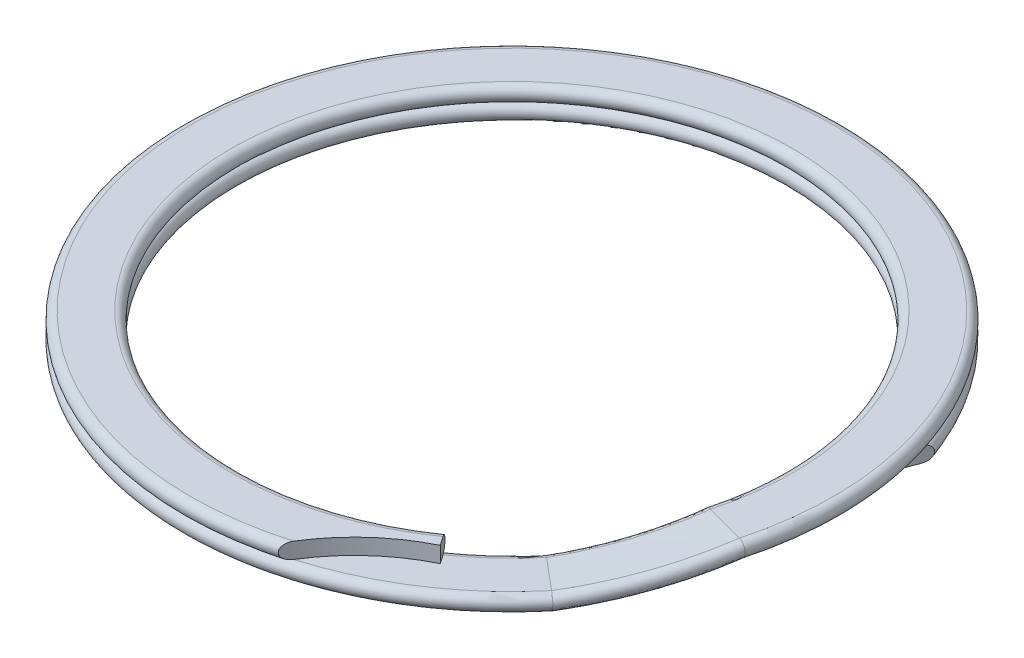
ISO-10303-21;
HEADER;
FILE_DESCRIPTION(('STEP AP214'),'2;1');
FILE_NAME('part.step','',(''),(''),'','','');
FILE_SCHEMA(('AUTOMOTIVE_DESIGN { 1 0 10303 214 1 1 1 1 }'));
ENDSEC;
DATA;
#1=APPLICATION_CONTEXT('core data for automotive mechanical design processes');
#2=APPLICATION_PROTOCOL_DEFINITION('international standard','automotive_design',2000,#1);
#3=PRODUCT_CONTEXT('',#1,'mechanical');
#4=PRODUCT('Part','Part','',(#3));
#5=PRODUCT_RELATED_PRODUCT_CATEGORY('part','',(#4));
#6=PRODUCT_DEFINITION_FORMATION('','',#4);
#7=PRODUCT_DEFINITION_CONTEXT('part definition',#1,'design');
#8=PRODUCT_DEFINITION('design','',#6,#7);
#9=PRODUCT_DEFINITION_SHAPE('','',#8);
#10=(LENGTH_UNIT() NAMED_UNIT(*) SI_UNIT(.MILLI.,.METRE.));
#11=(NAMED_UNIT(*) PLANE_ANGLE_UNIT() SI_UNIT($,.RADIAN.));
#12=(NAMED_UNIT(*) SI_UNIT($,.STERADIAN.) SOLID_ANGLE_UNIT());
#13=UNCERTAINTY_MEASURE_WITH_UNIT(LENGTH_MEASURE(1.E-05),#10,'distance_accuracy_value','');
#14=(GEOMETRIC_REPRESENTATION_CONTEXT(3) GLOBAL_UNCERTAINTY_ASSIGNED_CONTEXT((#13)) GLOBAL_UNIT_ASSIGNED_CONTEXT((#10,
#11,#12)) REPRESENTATION_CONTEXT('',''));
#15=CARTESIAN_POINT('',(0.,0.,0.));
#16=DIRECTION('',(0.,0.,1.));
#17=DIRECTION('',(1.,0.,0.));
#18=AXIS2_PLACEMENT_3D('',#15,#16,#17);
#19=CARTESIAN_POINT('',(7.21391450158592,-0.274300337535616,6.17161733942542));
#20=CARTESIAN_POINT('',(7.23357280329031,-0.270406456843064,6.14863903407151));
#21=CARTESIAN_POINT('',(8.14577918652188,-0.0887125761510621,5.07208295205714));
#22=CARTESIAN_POINT('',(8.8270057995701,0.0968674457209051,3.76345902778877));
#23=CARTESIAN_POINT('',(9.18564658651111,0.278553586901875,2.39879774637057));
#24=CARTESIAN_POINT('',(9.19317932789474,0.282439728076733,2.36957313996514));
#25=CARTESIAN_POINT('',(7.2026450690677,-0.277049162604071,6.16197616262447));
#26=CARTESIAN_POINT('',(7.22227266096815,-0.273155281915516,6.13903375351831));
#27=CARTESIAN_POINT('',(8.13305401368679,-0.091461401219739,5.06415944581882));
#28=CARTESIAN_POINT('',(8.81321642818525,0.0941186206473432,3.75757982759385));
#29=CARTESIAN_POINT('',(9.17129695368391,0.27580476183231,2.39505039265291));
#30=CARTESIAN_POINT('',(9.17881792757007,0.279690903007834,2.36587144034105));
#31=CARTESIAN_POINT('',(7.13813347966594,-0.284582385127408,6.10678548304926));
#32=CARTESIAN_POINT('',(7.15758527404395,-0.280688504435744,6.08404856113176));
#33=CARTESIAN_POINT('',(8.06020907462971,-0.0989946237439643,5.01880152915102));
#34=CARTESIAN_POINT('',(8.73427951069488,0.0865853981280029,3.72392449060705));
#35=CARTESIAN_POINT('',(9.08915283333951,0.26827153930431,2.37359875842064));
#36=CARTESIAN_POINT('',(9.09660644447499,0.272157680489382,2.344681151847));
#37=CARTESIAN_POINT('',(7.02108943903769,-0.220670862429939,6.00665246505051));
#38=CARTESIAN_POINT('',(7.04022228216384,-0.216776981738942,5.98428836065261));
#39=CARTESIAN_POINT('',(7.92804575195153,-0.0350831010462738,4.93650819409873));
#40=CARTESIAN_POINT('',(8.59106344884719,0.150496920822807,3.66286326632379));
#41=CARTESIAN_POINT('',(8.94011791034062,0.332183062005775,2.33467883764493));
#42=CARTESIAN_POINT('',(8.94744930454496,0.336069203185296,2.30623539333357));
#43=CARTESIAN_POINT('',(6.95522013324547,-0.0116816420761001,5.95030023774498));
#44=CARTESIAN_POINT('',(6.97417347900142,-0.00778776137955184,5.92814594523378));
#45=CARTESIAN_POINT('',(7.85366771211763,0.173906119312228,4.89019567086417));
#46=CARTESIAN_POINT('',(8.51046521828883,0.359486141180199,3.62849961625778));
#47=CARTESIAN_POINT('',(8.85624497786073,0.541172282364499,2.31277573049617));
#48=CARTESIAN_POINT('',(8.86350759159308,0.545058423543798,2.28459913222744));
#49=CARTESIAN_POINT('',(7.02108943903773,0.197307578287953,6.00665246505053));
#50=CARTESIAN_POINT('',(7.04022228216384,0.201201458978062,5.98428836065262));
#51=CARTESIAN_POINT('',(7.92804575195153,0.382895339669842,4.93650819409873));
#52=CARTESIAN_POINT('',(8.59106344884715,0.568475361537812,3.66286326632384));
#53=CARTESIAN_POINT('',(8.94011791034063,0.750161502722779,2.33467883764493));
#54=CARTESIAN_POINT('',(8.94744930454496,0.754047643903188,2.3062353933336));
#55=CARTESIAN_POINT('',(7.13813347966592,0.261219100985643,6.10678548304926));
#56=CARTESIAN_POINT('',(7.15758527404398,0.265112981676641,6.08404856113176));
#57=CARTESIAN_POINT('',(8.0602090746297,0.446806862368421,5.01880152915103));
#58=CARTESIAN_POINT('',(8.73427951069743,0.6323868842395,3.72392449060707));
#59=CARTESIAN_POINT('',(9.0891528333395,0.814073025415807,2.37359875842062));
#60=CARTESIAN_POINT('',(9.09660644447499,0.817959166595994,2.34468115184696));
#61=CARTESIAN_POINT('',(7.2026450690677,0.253685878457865,6.16197616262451));
#62=CARTESIAN_POINT('',(7.22227266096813,0.257579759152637,6.13903375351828));
#63=CARTESIAN_POINT('',(8.13305401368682,0.439273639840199,5.06415944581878));
#64=CARTESIAN_POINT('',(8.81321642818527,0.624853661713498,3.75757982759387));
#65=CARTESIAN_POINT('',(9.17129695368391,0.806539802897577,2.3950503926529));
#66=CARTESIAN_POINT('',(9.17881792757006,0.810425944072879,2.36587144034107));
#67=CARTESIAN_POINT('',(7.21391450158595,0.250937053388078,6.17161733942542));
#68=CARTESIAN_POINT('',(7.23357280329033,0.254830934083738,6.1486390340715));
#69=CARTESIAN_POINT('',(8.14577918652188,0.436524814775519,5.07208295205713));
#70=CARTESIAN_POINT('',(8.82700579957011,0.622104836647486,3.76345902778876));
#71=CARTESIAN_POINT('',(9.18564658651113,0.80379097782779,2.39879774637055));
#72=CARTESIAN_POINT('',(9.19317932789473,0.807677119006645,2.36957313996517));
#73=B_SPLINE_SURFACE_WITH_KNOTS('',3,3,((#19,#20,#21,#22,#23,#24),(#25,#26,#27,#28,#29,#30),
(#31,#32,#33,#34,#35,#36),(#37,#38,#39,#40,#41,#42),(#43,#44,#45,#46,#47,#48),(#49,#50,#51,#52,
#53,#54),(#55,#56,#57,#58,#59,#60),(#61,#62,#63,#64,#65,#66),(#67,#68,#69,#70,#71,#72)),
.UNSPECIFIED.,.F.,.F.,.F.,(4,1,1,1,1,1,4),(4,1,1,4),(-0.05372257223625,0.,0.25,0.5,0.75,1.,
1.053722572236),(-0.009555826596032,0.,0.4363323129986,0.4458691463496),.UNSPECIFIED.);
#74=CARTESIAN_POINT('',(9.12683994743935,0.800100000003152,2.44552939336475));
#75=CARTESIAN_POINT('',(9.08237917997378,0.777875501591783,2.61145465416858));
#76=CARTESIAN_POINT('',(9.03334385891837,0.755650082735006,2.77614915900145));
#77=CARTESIAN_POINT('',(8.92635746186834,0.711199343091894,3.1026145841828));
#78=CARTESIAN_POINT('',(8.86840650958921,0.688974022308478,3.2643855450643));
#79=CARTESIAN_POINT('',(8.74381797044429,0.644523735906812,3.58455411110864));
#80=CARTESIAN_POINT('',(8.67717996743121,0.622298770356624,3.74295155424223));
#81=CARTESIAN_POINT('',(8.53547135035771,0.577849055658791,4.0559397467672));
#82=CARTESIAN_POINT('',(8.46040024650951,0.555624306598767,4.21053027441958));
#83=CARTESIAN_POINT('',(8.3019707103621,0.511174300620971,4.51541987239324));
#84=CARTESIAN_POINT('',(8.21861175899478,0.488949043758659,4.66571867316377));
#85=CARTESIAN_POINT('',(8.04376833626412,0.4444988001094,4.96150808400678));
#86=CARTESIAN_POINT('',(7.95228411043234,0.422273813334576,5.1069988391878));
#87=CARTESIAN_POINT('',(7.76145547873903,0.377823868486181,5.39271819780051));
#88=CARTESIAN_POINT('',(7.6621115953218,0.35559891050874,5.53294715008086));
#89=CARTESIAN_POINT('',(7.45580773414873,0.311149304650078,5.80767387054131));
#90=CARTESIAN_POINT('',(7.34884813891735,0.288924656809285,5.94217192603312));
#91=CARTESIAN_POINT('',(7.2382003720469,0.266699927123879,6.07357199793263));
#92=B_SPLINE_CURVE_WITH_KNOTS('',3,(#74,#75,#76,#77,#78,#79,#80,#81,#82,#83,#84,#85,#86,#87,#88,
#89,#90,#91),.UNSPECIFIED.,.F.,.F.,(4,2,2,2,2,2,2,2,4),(0.,0.519560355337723,1.03911350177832,
1.5586915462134,2.07829978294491,2.59794058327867,3.11756568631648,3.63715627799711,
4.15672078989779),.UNSPECIFIED.);
#93=CARTESIAN_POINT('',(9.12683994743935,0.800100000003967,2.44552939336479));
#94=VERTEX_POINT('',#93);
#95=CARTESIAN_POINT('',(7.23820036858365,0.266699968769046,6.07357200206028));
#96=VERTEX_POINT('',#95);
#97=EDGE_CURVE('E564',#94,#96,#92,.T.);
#98=CARTESIAN_POINT('',(8.86922752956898,0.533400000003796,2.37650235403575));
#99=CARTESIAN_POINT('',(8.8694264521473,0.537052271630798,2.37575884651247));
#100=CARTESIAN_POINT('',(8.8696780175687,0.540720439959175,2.37511053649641));
#101=CARTESIAN_POINT('',(8.87030402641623,0.548216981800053,2.3739691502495));
#102=CARTESIAN_POINT('',(8.87068285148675,0.552046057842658,2.37348305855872));
#103=CARTESIAN_POINT('',(8.87158374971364,0.559856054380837,2.37267123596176));
#104=CARTESIAN_POINT('',(8.87211080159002,0.56383711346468,2.37235244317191));
#105=CARTESIAN_POINT('',(8.87332842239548,0.571941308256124,2.37188092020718));
#106=CARTESIAN_POINT('',(8.87402450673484,0.576064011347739,2.37173505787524));
#107=CARTESIAN_POINT('',(8.87560089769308,0.584439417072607,2.37161510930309));
#108=CARTESIAN_POINT('',(8.87648721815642,0.58869108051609,2.37164778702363));
#109=CARTESIAN_POINT('',(8.87846481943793,0.597310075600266,2.37189082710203));
#110=CARTESIAN_POINT('',(8.87956256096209,0.601675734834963,2.37210783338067));
#111=CARTESIAN_POINT('',(8.8819836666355,0.610505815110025,2.37272515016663));
#112=CARTESIAN_POINT('',(8.88331388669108,0.614967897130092,2.37313195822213));
#113=CARTESIAN_POINT('',(8.88622004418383,0.623971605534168,2.37413567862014));
#114=CARTESIAN_POINT('',(8.8878031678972,0.628510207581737,2.37473897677));
#115=CARTESIAN_POINT('',(8.89047956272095,0.635632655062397,2.37582962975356));
#116=CARTESIAN_POINT('',(8.89150552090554,0.638250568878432,2.37626215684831));
#117=CARTESIAN_POINT('',(8.89364718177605,0.643499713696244,2.37719776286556));
#118=CARTESIAN_POINT('',(8.89476427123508,0.64613015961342,2.3777020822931));
#119=CARTESIAN_POINT('',(8.89680167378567,0.650730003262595,2.37862360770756));
#120=CARTESIAN_POINT('',(8.8977057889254,0.652708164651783,2.37903309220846));
#121=CARTESIAN_POINT('',(8.89955030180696,0.656610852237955,2.37984854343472));
#122=CARTESIAN_POINT('',(8.90048995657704,0.658535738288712,2.38025447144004));
#123=CARTESIAN_POINT('',(8.90364356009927,0.664797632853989,2.38159424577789));
#124=CARTESIAN_POINT('',(8.90595558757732,0.669082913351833,2.38254169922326));
#125=CARTESIAN_POINT('',(8.91072931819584,0.67735806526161,2.38442548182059));
#126=CARTESIAN_POINT('',(8.91318257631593,0.681353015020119,2.38536097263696));
#127=CARTESIAN_POINT('',(8.9182078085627,0.689051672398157,2.38721358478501));
#128=CARTESIAN_POINT('',(8.92077188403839,0.692760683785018,2.38813007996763));
#129=CARTESIAN_POINT('',(8.92598989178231,0.699893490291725,2.38993644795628));
#130=CARTESIAN_POINT('',(8.92863645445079,0.703322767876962,2.39082597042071));
#131=CARTESIAN_POINT('',(8.93399256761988,0.709904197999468,2.39257097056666));
#132=CARTESIAN_POINT('',(8.93669526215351,0.713061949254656,2.39342637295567));
#133=CARTESIAN_POINT('',(8.94213860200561,0.719109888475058,2.39509631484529));
#134=CARTESIAN_POINT('',(8.9448728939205,0.722005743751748,2.3959110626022));
#135=CARTESIAN_POINT('',(8.95072995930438,0.727917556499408,2.39760030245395));
#136=CARTESIAN_POINT('',(8.95386561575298,0.730921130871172,2.39847362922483));
#137=CARTESIAN_POINT('',(8.95862354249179,0.735244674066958,2.39974882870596));
#138=CARTESIAN_POINT('',(8.96018568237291,0.736628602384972,2.40015990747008));
#139=CARTESIAN_POINT('',(8.963303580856,0.739320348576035,2.40096066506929));
#140=CARTESIAN_POINT('',(8.96485836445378,0.740629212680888,2.40135062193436));
#141=CARTESIAN_POINT('',(8.96912931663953,0.744138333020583,2.40241365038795));
#142=CARTESIAN_POINT('',(8.97187550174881,0.746301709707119,2.40308836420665));
#143=CARTESIAN_POINT('',(8.97727168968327,0.750380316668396,2.40442106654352));
#144=CARTESIAN_POINT('',(8.97991678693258,0.752302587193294,2.40507741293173));
#145=CARTESIAN_POINT('',(8.98509412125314,0.755917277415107,2.40636217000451));
#146=CARTESIAN_POINT('',(8.98762191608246,0.757616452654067,2.4069894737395));
#147=CARTESIAN_POINT('',(8.99254811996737,0.760802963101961,2.40821337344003));
#148=CARTESIAN_POINT('',(8.99494263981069,0.762296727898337,2.4088089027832));
#149=CARTESIAN_POINT('',(8.99994156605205,0.765302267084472,2.41005308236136));
#150=CARTESIAN_POINT('',(9.00254917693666,0.766808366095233,2.41070259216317));
#151=CARTESIAN_POINT('',(9.00755114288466,0.769581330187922,2.4119494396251));
#152=CARTESIAN_POINT('',(9.00994089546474,0.77085708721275,2.4125455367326));
#153=CARTESIAN_POINT('',(9.01636744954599,0.774158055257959,2.41415004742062));
#154=CARTESIAN_POINT('',(9.02043765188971,0.776114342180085,2.41516778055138));
#155=CARTESIAN_POINT('',(9.02757992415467,0.77931678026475,2.41695427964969));
#156=CARTESIAN_POINT('',(9.03063073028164,0.780613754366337,2.41771756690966));
#157=CARTESIAN_POINT('',(9.03566849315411,0.782640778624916,2.41898436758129));
#158=CARTESIAN_POINT('',(9.03764249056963,0.78340665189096,2.41948233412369));
#159=CARTESIAN_POINT('',(9.0405236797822,0.784482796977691,2.42020483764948));
#160=CARTESIAN_POINT('',(9.04142327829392,0.784812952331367,2.42042982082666));
#161=CARTESIAN_POINT('',(9.04402876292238,0.785755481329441,2.42111489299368));
#162=CARTESIAN_POINT('',(9.0457317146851,0.786354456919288,2.42160435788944));
#163=CARTESIAN_POINT('',(9.0491535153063,0.787514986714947,2.42257073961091));
#164=CARTESIAN_POINT('',(9.05087236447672,0.788076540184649,2.42304765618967));
#165=CARTESIAN_POINT('',(9.0566172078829,0.789885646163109,2.42465377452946));
#166=CARTESIAN_POINT('',(9.0606638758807,0.791049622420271,2.42580489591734));
#167=CARTESIAN_POINT('',(9.06880311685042,0.793169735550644,2.42813595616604));
#168=CARTESIAN_POINT('',(9.07289569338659,0.794125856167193,2.42931589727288));
#169=CARTESIAN_POINT('',(9.08111552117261,0.795828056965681,2.43170803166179));
#170=CARTESIAN_POINT('',(9.08524277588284,0.796574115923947,2.43292022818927));
#171=CARTESIAN_POINT('',(9.0935222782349,0.797854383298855,2.43537267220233));
#172=CARTESIAN_POINT('',(9.09767452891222,0.798388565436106,2.43661292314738));
#173=CARTESIAN_POINT('',(9.10599383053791,0.799243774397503,2.43911928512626));
#174=CARTESIAN_POINT('',(9.11016088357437,0.799564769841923,2.44038539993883));
#175=CARTESIAN_POINT('',(9.11849965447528,0.799992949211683,2.44294077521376));
#176=CARTESIAN_POINT('',(9.12267137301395,0.800100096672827,2.44423003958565));
#177=CARTESIAN_POINT('',(9.12683994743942,0.800100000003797,2.44552939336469));
#178=B_SPLINE_CURVE_WITH_KNOTS('',3,(#98,#99,#100,#101,#102,#103,#104,#105,#106,#107,#108,#109,
#110,#111,#112,#113,#114,#115,#116,#117,#118,#119,#120,#121,#122,#123,#124,#125,#126,#127,#128,
#129,#130,#131,#132,#133,#134,#135,#136,#137,#138,#139,#140,#141,#142,#143,#144,#145,#146,#147,
#148,#149,#150,#151,#152,#153,#154,#155,#156,#157,#158,#159,#160,#161,#162,#163,#164,#165,#166,
#167,#168,#169,#170,#171,#172,#173,#174,#175,#176,#177),.UNSPECIFIED.,.F.,.F.,(4,2,2,2,2,2,2,2,
2,2,2,2,2,2,2,2,2,2,2,2,2,2,2,2,2,2,2,2,2,2,2,2,2,2,2,2,2,2,2,4),(0.,0.0111949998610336,
0.0228235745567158,0.0349024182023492,0.0474464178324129,0.0604688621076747,0.0739816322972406,
0.0879953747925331,0.102519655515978,0.111052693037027,0.119756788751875,0.126395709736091,
0.132935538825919,0.147808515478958,0.162143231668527,0.17594054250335,0.189201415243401,
0.201926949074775,0.21411839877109,0.227399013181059,0.233779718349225,0.239987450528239,
0.250665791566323,0.260668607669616,0.269995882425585,0.2786476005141,0.287887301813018,
0.29620748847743,0.310088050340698,0.320290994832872,0.326815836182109,0.329768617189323,
0.335378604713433,0.340988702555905,0.354078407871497,0.36716913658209,0.380261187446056,
0.393354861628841,0.406450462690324,0.419548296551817),.UNSPECIFIED.);
#179=CARTESIAN_POINT('',(8.86922752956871,0.533400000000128,2.37650235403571));
#180=VERTEX_POINT('',#179);
#181=EDGE_CURVE('E575',#180,#94,#178,.T.);
#182=CARTESIAN_POINT('',(9.12683994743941,0.266700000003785,2.44552939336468));
#183=CARTESIAN_POINT('',(9.12503529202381,0.266699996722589,2.44505061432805));
#184=CARTESIAN_POINT('',(9.12322760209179,0.266719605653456,2.44458360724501));
#185=CARTESIAN_POINT('',(9.11894148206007,0.266812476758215,2.44349632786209));
#186=CARTESIAN_POINT('',(9.11646162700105,0.266902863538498,2.44288307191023));
#187=CARTESIAN_POINT('',(9.11083475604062,0.267191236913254,2.44150361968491));
#188=CARTESIAN_POINT('',(9.10768807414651,0.267411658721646,2.44074075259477));
#189=CARTESIAN_POINT('',(9.10073460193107,0.268029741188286,2.43906751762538));
#190=CARTESIAN_POINT('',(9.09692950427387,0.268455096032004,2.4381602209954));
#191=CARTESIAN_POINT('',(9.08935271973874,0.269476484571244,2.43636138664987));
#192=CARTESIAN_POINT('',(9.08558096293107,0.270071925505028,2.43546980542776));
#193=CARTESIAN_POINT('',(9.07757836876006,0.271520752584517,2.43359147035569));
#194=CARTESIAN_POINT('',(9.07335113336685,0.27239751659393,2.43260729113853));
#195=CARTESIAN_POINT('',(9.06536242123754,0.27426891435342,2.43072988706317));
#196=CARTESIAN_POINT('',(9.06159607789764,0.27524343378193,2.42983725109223));
#197=CARTESIAN_POINT('',(9.05411811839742,0.277365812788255,2.42802152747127));
#198=CARTESIAN_POINT('',(9.05040652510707,0.27851374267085,2.42709842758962));
#199=CARTESIAN_POINT('',(9.04350435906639,0.280826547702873,2.42534820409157));
#200=CARTESIAN_POINT('',(9.04030648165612,0.281971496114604,2.42452345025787));
#201=CARTESIAN_POINT('',(9.0339624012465,0.284390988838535,2.42285759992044));
#202=CARTESIAN_POINT('',(9.03081622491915,0.285665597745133,2.42201649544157));
#203=CARTESIAN_POINT('',(9.025471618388,0.287959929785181,2.4205631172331));
#204=CARTESIAN_POINT('',(9.02325892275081,0.288948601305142,2.41995403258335));
#205=CARTESIAN_POINT('',(9.0188645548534,0.290990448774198,2.41872743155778));
#206=CARTESIAN_POINT('',(9.01668289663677,0.292043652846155,2.41810991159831));
#207=CARTESIAN_POINT('',(9.01307983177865,0.293848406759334,2.41708252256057));
#208=CARTESIAN_POINT('',(9.01164952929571,0.294582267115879,2.41667267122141));
#209=CARTESIAN_POINT('',(9.00883122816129,0.296062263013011,2.41586641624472));
#210=CARTESIAN_POINT('',(9.00744296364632,0.296807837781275,2.41546990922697));
#211=CARTESIAN_POINT('',(9.00145393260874,0.300096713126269,2.4137596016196));
#212=CARTESIAN_POINT('',(8.99691969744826,0.302773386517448,2.41246536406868));
#213=CARTESIAN_POINT('',(8.98835838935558,0.308191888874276,2.41002568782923));
#214=CARTESIAN_POINT('',(8.98431913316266,0.310912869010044,2.40887646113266));
#215=CARTESIAN_POINT('',(8.97672321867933,0.316350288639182,2.40671965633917));
#216=CARTESIAN_POINT('',(8.97315439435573,0.319048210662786,2.40570825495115));
#217=CARTESIAN_POINT('',(8.96647213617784,0.324377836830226,2.4038199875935));
#218=CARTESIAN_POINT('',(8.96334679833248,0.32699326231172,2.40293925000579));
#219=CARTESIAN_POINT('',(8.95752238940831,0.332104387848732,2.40130444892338));
#220=CARTESIAN_POINT('',(8.95481194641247,0.334585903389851,2.40054652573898));
#221=CARTESIAN_POINT('',(8.94978769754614,0.339383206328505,2.39914981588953));
#222=CARTESIAN_POINT('',(8.9474632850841,0.341686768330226,2.39850714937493));
#223=CARTESIAN_POINT('',(8.94318233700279,0.34608922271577,2.39733255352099));
#224=CARTESIAN_POINT('',(8.94121613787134,0.348177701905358,2.39679682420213));
#225=CARTESIAN_POINT('',(8.93762372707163,0.352117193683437,2.39583161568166));
#226=CARTESIAN_POINT('',(8.93598907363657,0.353959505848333,2.39539789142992));
#227=CARTESIAN_POINT('',(8.93196268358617,0.358624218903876,2.39434108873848));
#228=CARTESIAN_POINT('',(8.92960104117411,0.361476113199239,2.39373175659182));
#229=CARTESIAN_POINT('',(8.92660403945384,0.365225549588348,2.393047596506));
#230=CARTESIAN_POINT('',(8.92592927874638,0.366078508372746,2.39289957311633));
#231=CARTESIAN_POINT('',(8.92402396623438,0.368512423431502,2.39249759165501));
#232=CARTESIAN_POINT('',(8.92280259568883,0.370103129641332,2.39225907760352));
#233=CARTESIAN_POINT('',(8.9203950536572,0.373312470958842,2.39179087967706));
#234=CARTESIAN_POINT('',(8.91920888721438,0.374931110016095,2.39156119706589));
#235=CARTESIAN_POINT('',(8.91599296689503,0.379419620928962,2.39095394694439));
#236=CARTESIAN_POINT('',(8.91399802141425,0.382317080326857,2.39059472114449));
#237=CARTESIAN_POINT('',(8.91011561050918,0.388189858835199,2.38992580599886));
#238=CARTESIAN_POINT('',(8.9082281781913,0.391165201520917,2.38961613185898));
#239=CARTESIAN_POINT('',(8.90456324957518,0.397189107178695,2.38904855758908));
#240=CARTESIAN_POINT('',(8.90278579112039,0.400237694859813,2.38879067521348));
#241=CARTESIAN_POINT('',(8.89934362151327,0.406403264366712,2.38832707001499));
#242=CARTESIAN_POINT('',(8.89767895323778,0.409520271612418,2.38812136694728));
#243=CARTESIAN_POINT('',(8.89446492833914,0.415817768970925,2.38776262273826));
#244=CARTESIAN_POINT('',(8.89291561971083,0.418998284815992,2.38760960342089));
#245=CARTESIAN_POINT('',(8.8899343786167,0.4254177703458,2.38735784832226));
#246=CARTESIAN_POINT('',(8.88850249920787,0.428656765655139,2.38725913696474));
#247=CARTESIAN_POINT('',(8.88615129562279,0.434254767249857,2.38713366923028));
#248=CARTESIAN_POINT('',(8.88520231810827,0.436601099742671,2.38709441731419));
#249=CARTESIAN_POINT('',(8.8833645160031,0.44131856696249,2.3870505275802));
#250=CARTESIAN_POINT('',(8.8824757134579,0.443689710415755,2.38704590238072));
#251=CARTESIAN_POINT('',(8.88132453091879,0.446901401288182,2.38704111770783));
#252=CARTESIAN_POINT('',(8.88103182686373,0.447731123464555,2.3870400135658));
#253=CARTESIAN_POINT('',(8.8804551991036,0.449400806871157,2.38702705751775));
#254=CARTESIAN_POINT('',(8.88017136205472,0.450240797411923,2.387015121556));
#255=CARTESIAN_POINT('',(8.87890040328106,0.454081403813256,2.38694244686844));
#256=CARTESIAN_POINT('',(8.87797520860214,0.457102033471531,2.38683503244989));
#257=CARTESIAN_POINT('',(8.87623649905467,0.463264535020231,2.38652133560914));
#258=CARTESIAN_POINT('',(8.87542699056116,0.466407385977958,2.38631228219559));
#259=CARTESIAN_POINT('',(8.87392962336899,0.472813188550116,2.38579941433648));
#260=CARTESIAN_POINT('',(8.87324608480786,0.476076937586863,2.38549297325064));
#261=CARTESIAN_POINT('',(8.87201146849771,0.482722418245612,2.38478791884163));
#262=CARTESIAN_POINT('',(8.87146500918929,0.48610473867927,2.38438680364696));
#263=CARTESIAN_POINT('',(8.87051551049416,0.492984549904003,2.38349544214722));
#264=CARTESIAN_POINT('',(8.87011735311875,0.496482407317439,2.38300285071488));
#265=CARTESIAN_POINT('',(8.86947570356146,0.503589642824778,2.38193144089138));
#266=CARTESIAN_POINT('',(8.86923732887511,0.507199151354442,2.38135044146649));
#267=CARTESIAN_POINT('',(8.86892668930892,0.514525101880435,2.38010524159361));
#268=CARTESIAN_POINT('',(8.86885974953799,0.518241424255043,2.37943903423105));
#269=CARTESIAN_POINT('',(8.86890352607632,0.525775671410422,2.37802605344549));
#270=CARTESIAN_POINT('',(8.86901974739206,0.529593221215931,2.37727743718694));
#271=CARTESIAN_POINT('',(8.86922752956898,0.533400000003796,2.37650235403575));
#272=B_SPLINE_CURVE_WITH_KNOTS('',3,(#182,#183,#184,#185,#186,#187,#188,#189,#190,#191,#192,
#193,#194,#195,#196,#197,#198,#199,#200,#201,#202,#203,#204,#205,#206,#207,#208,#209,#210,#211,
#212,#213,#214,#215,#216,#217,#218,#219,#220,#221,#222,#223,#224,#225,#226,#227,#228,#229,#230,
#231,#232,#233,#234,#235,#236,#237,#238,#239,#240,#241,#242,#243,#244,#245,#246,#247,#248,#249,
#250,#251,#252,#253,#254,#255,#256,#257,#258,#259,#260,#261,#262,#263,#264,#265,#266,#267,#268,
#269,#270,#271),.UNSPECIFIED.,.F.,.F.,(4,2,2,2,2,2,2,2,2,2,2,2,2,2,2,2,2,2,2,2,2,2,2,2,2,2,2,2,
2,2,2,2,2,2,2,2,2,2,2,2,2,2,2,2,4),(0.,0.00560100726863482,0.013268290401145,0.0230021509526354,
0.0348026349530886,0.0465624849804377,0.059840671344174,0.0718110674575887,0.0837863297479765,
0.0942697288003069,0.104758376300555,0.112254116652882,0.119753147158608,0.124729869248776,
0.129604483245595,0.145859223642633,0.160863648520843,0.174617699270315,0.187121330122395,
0.198374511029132,0.208377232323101,0.217129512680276,0.22463141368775,0.235884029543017,
0.239176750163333,0.245234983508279,0.251294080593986,0.261899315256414,0.27250779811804,
0.283119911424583,0.293736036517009,0.304356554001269,0.314981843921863,0.322574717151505,
0.330170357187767,0.332809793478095,0.335469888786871,0.344947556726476,0.354699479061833,
0.364740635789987,0.375084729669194,0.385744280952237,0.396730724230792,0.40805450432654,
0.419725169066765),.UNSPECIFIED.);
#273=CARTESIAN_POINT('',(9.1268399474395,0.266700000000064,2.44552939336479));
#274=VERTEX_POINT('',#273);
#275=EDGE_CURVE('E532',#274,#180,#272,.T.);
#276=CARTESIAN_POINT('',(7.23820258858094,-0.266699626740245,6.07356935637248));
#277=CARTESIAN_POINT('',(7.34861872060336,-0.244475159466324,5.94197852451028));
#278=CARTESIAN_POINT('',(7.45540283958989,-0.222249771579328,5.80734639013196));
#279=CARTESIAN_POINT('',(7.66146238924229,-0.177799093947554,5.53245569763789));
#280=CARTESIAN_POINT('',(7.7607379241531,-0.155573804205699,5.39219721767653));
#281=CARTESIAN_POINT('',(7.95154329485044,-0.111123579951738,5.10649949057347));
#282=CARTESIAN_POINT('',(8.04307275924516,-0.0888986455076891,4.96105999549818));
#283=CARTESIAN_POINT('',(8.21817673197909,-0.0444489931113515,4.66545687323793));
#284=CARTESIAN_POINT('',(8.30175077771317,-0.0222242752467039,4.51529297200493));
#285=CARTESIAN_POINT('',(8.4606302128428,0.0222256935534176,4.21063790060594));
#286=CARTESIAN_POINT('',(8.53593507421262,0.0444509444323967,4.05614645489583));
#287=CARTESIAN_POINT('',(8.67794552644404,0.0889011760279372,3.74326537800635));
#288=CARTESIAN_POINT('',(8.74465137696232,0.111126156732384,3.58487586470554));
#289=CARTESIAN_POINT('',(8.86924414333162,0.155576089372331,3.26467639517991));
#290=CARTESIAN_POINT('',(8.92713164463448,0.177801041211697,3.10286666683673));
#291=CARTESIAN_POINT('',(9.03384350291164,0.222250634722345,2.7762957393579));
#292=CARTESIAN_POINT('',(9.08266831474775,0.244475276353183,2.61153468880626));
#293=CARTESIAN_POINT('',(9.12683994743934,0.26670000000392,2.44552939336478));
#294=B_SPLINE_CURVE_WITH_KNOTS('',3,(#276,#277,#278,#279,#280,#281,#282,#283,#284,#285,#286,
#287,#288,#289,#290,#291,#292,#293),.UNSPECIFIED.,.F.,.F.,(4,2,2,2,2,2,2,2,4),(0.,
0.519559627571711,1.03911204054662,1.55868934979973,2.07829685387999,2.59793751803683,
3.11756248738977,3.6371529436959,4.15671731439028),.UNSPECIFIED.);
#295=CARTESIAN_POINT('',(7.23820259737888,-0.266699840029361,6.07356934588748));
#296=VERTEX_POINT('',#295);
#297=EDGE_CURVE('E490',#296,#274,#294,.T.);
#298=CARTESIAN_POINT('',(7.03389668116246,3.89737621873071E-12,5.9021401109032));
#299=CARTESIAN_POINT('',(7.03356877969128,-0.00241970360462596,5.90253078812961));
#300=CARTESIAN_POINT('',(7.03328909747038,-0.00484677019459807,5.90291535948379));
#301=CARTESIAN_POINT('',(7.03281645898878,-0.00978348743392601,5.90368815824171));
#302=CARTESIAN_POINT('',(7.03262633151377,-0.0122934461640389,5.90407615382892));
#303=CARTESIAN_POINT('',(7.03233814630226,-0.0173936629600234,5.90486040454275));
#304=CARTESIAN_POINT('',(7.03224298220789,-0.0199840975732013,5.90525656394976));
#305=CARTESIAN_POINT('',(7.03215022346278,-0.0252427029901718,5.9060616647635));
#306=CARTESIAN_POINT('',(7.03215557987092,-0.0279109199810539,5.90647063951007));
#307=CARTESIAN_POINT('',(7.03226946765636,-0.0333220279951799,5.90730602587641));
#308=CARTESIAN_POINT('',(7.03238099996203,-0.0360648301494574,5.90773259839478));
#309=CARTESIAN_POINT('',(7.03271293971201,-0.0416215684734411,5.90860788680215));
#310=CARTESIAN_POINT('',(7.0329363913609,-0.0444352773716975,5.90905688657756));
#311=CARTESIAN_POINT('',(7.03349793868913,-0.0501297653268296,5.90998178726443));
#312=CARTESIAN_POINT('',(7.03383911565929,-0.0530101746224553,5.91045809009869));
#313=CARTESIAN_POINT('',(7.03464192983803,-0.0588334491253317,5.91144237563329));
#314=CARTESIAN_POINT('',(7.03510667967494,-0.0617757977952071,5.911950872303));
#315=CARTESIAN_POINT('',(7.03616246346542,-0.0677177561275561,5.9130043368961));
#316=CARTESIAN_POINT('',(7.03675663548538,-0.0707166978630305,5.91354992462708));
#317=CARTESIAN_POINT('',(7.03807711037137,-0.0767660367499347,5.91468229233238));
#318=CARTESIAN_POINT('',(7.03880657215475,-0.079815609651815,5.915269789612));
#319=CARTESIAN_POINT('',(7.04040328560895,-0.0859597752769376,5.91649081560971));
#320=CARTESIAN_POINT('',(7.04127370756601,-0.089053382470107,5.91712515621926));
#321=CARTESIAN_POINT('',(7.04315846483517,-0.095278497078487,5.9184439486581));
#322=CARTESIAN_POINT('',(7.04417599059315,-0.098408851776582,5.91912928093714));
#323=CARTESIAN_POINT('',(7.04619921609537,-0.104239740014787,5.92045225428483));
#324=CARTESIAN_POINT('',(7.0471911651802,-0.10694605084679,5.92108548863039));
#325=CARTESIAN_POINT('',(7.04929236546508,-0.112374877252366,5.92239009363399));
#326=CARTESIAN_POINT('',(7.05040370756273,-0.115096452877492,5.92306199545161));
#327=CARTESIAN_POINT('',(7.0532929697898,-0.121879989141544,5.9248145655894));
#328=CARTESIAN_POINT('',(7.05512017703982,-0.125912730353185,5.92592799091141));
#329=CARTESIAN_POINT('',(7.05792803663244,-0.131805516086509,5.92769409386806));
#330=CARTESIAN_POINT('',(7.05885682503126,-0.13370875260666,5.92828661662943));
#331=CARTESIAN_POINT('',(7.0607240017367,-0.137440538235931,5.929489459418));
#332=CARTESIAN_POINT('',(7.06166156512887,-0.139269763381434,5.93009896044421));
#333=CARTESIAN_POINT('',(7.06422261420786,-0.144150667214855,5.93178050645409));
#334=CARTESIAN_POINT('',(7.06587420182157,-0.147177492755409,5.9328822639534));
#335=CARTESIAN_POINT('',(7.06918142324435,-0.153009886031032,5.93512285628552));
#336=CARTESIAN_POINT('',(7.07083327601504,-0.155819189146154,5.93625756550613));
#337=CARTESIAN_POINT('',(7.07412613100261,-0.161223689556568,5.93855191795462));
#338=CARTESIAN_POINT('',(7.07576371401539,-0.163822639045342,5.93970762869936));
#339=CARTESIAN_POINT('',(7.07901431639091,-0.168814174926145,5.94203260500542));
#340=CARTESIAN_POINT('',(7.0806242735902,-0.171210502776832,5.94319812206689));
#341=CARTESIAN_POINT('',(7.08380701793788,-0.175805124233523,5.94553230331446));
#342=CARTESIAN_POINT('',(7.08537709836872,-0.178007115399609,5.94669738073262));
#343=CARTESIAN_POINT('',(7.08846846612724,-0.182221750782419,5.94902126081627));
#344=CARTESIAN_POINT('',(7.0899874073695,-0.18423802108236,5.95017661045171));
#345=CARTESIAN_POINT('',(7.09296617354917,-0.188090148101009,5.95247221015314));
#346=CARTESIAN_POINT('',(7.09442400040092,-0.189929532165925,5.95360912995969));
#347=CARTESIAN_POINT('',(7.09727021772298,-0.193436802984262,5.95586086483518));
#348=CARTESIAN_POINT('',(7.09865702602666,-0.195108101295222,5.95697238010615));
#349=CARTESIAN_POINT('',(7.10222538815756,-0.199314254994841,5.95987070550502));
#350=CARTESIAN_POINT('',(7.10442149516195,-0.20181443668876,5.96169041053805));
#351=CARTESIAN_POINT('',(7.10853761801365,-0.206373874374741,5.96523318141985));
#352=CARTESIAN_POINT('',(7.11045649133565,-0.208448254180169,5.96693815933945));
#353=CARTESIAN_POINT('',(7.11430266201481,-0.212480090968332,5.9704142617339));
#354=CARTESIAN_POINT('',(7.11622970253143,-0.214438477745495,5.9721845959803));
#355=CARTESIAN_POINT('',(7.12015652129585,-0.218258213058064,5.9757484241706));
#356=CARTESIAN_POINT('',(7.12215629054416,-0.220119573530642,5.97754191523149));
#357=CARTESIAN_POINT('',(7.1262126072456,-0.223742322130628,5.9811646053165));
#358=CARTESIAN_POINT('',(7.12826914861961,-0.225503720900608,5.98299380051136));
#359=CARTESIAN_POINT('',(7.13243974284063,-0.22892429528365,5.9866815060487));
#360=CARTESIAN_POINT('',(7.13455379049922,-0.230583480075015,5.98854001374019));
#361=CARTESIAN_POINT('',(7.1385679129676,-0.233596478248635,5.99205088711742));
#362=CARTESIAN_POINT('',(7.14046168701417,-0.234962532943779,5.99369996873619));
#363=CARTESIAN_POINT('',(7.14428855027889,-0.237613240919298,5.99701759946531));
#364=CARTESIAN_POINT('',(7.14622163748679,-0.238897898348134,5.9986861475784));
#365=CARTESIAN_POINT('',(7.15012505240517,-0.241384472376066,6.00204104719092));
#366=CARTESIAN_POINT('',(7.15209537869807,-0.242586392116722,6.00372739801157));
#367=CARTESIAN_POINT('',(7.1560712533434,-0.244906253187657,6.00711614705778));
#368=CARTESIAN_POINT('',(7.15807680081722,-0.24602419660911,6.00881854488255));
#369=CARTESIAN_POINT('',(7.16212104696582,-0.248174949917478,6.01223762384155));
#370=CARTESIAN_POINT('',(7.16415974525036,-0.249207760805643,6.01395430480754));
#371=CARTESIAN_POINT('',(7.16826820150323,-0.251187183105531,6.01740015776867));
#372=CARTESIAN_POINT('',(7.17033795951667,-0.252133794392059,6.01912932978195));
#373=CARTESIAN_POINT('',(7.17450641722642,-0.253939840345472,6.02259835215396));
#374=CARTESIAN_POINT('',(7.17660511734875,-0.254799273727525,6.02433820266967));
#375=CARTESIAN_POINT('',(7.18082931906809,-0.256430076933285,6.02782674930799));
#376=CARTESIAN_POINT('',(7.18295482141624,-0.257201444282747,6.02957544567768));
#377=CARTESIAN_POINT('',(7.18723046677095,-0.258655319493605,6.03307983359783));
#378=CARTESIAN_POINT('',(7.18938061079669,-0.259337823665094,6.03483552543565));
#379=CARTESIAN_POINT('',(7.19370336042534,-0.260613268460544,6.0383520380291));
#380=CARTESIAN_POINT('',(7.19587596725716,-0.261206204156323,6.04011285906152));
#381=CARTESIAN_POINT('',(7.20024144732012,-0.262301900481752,6.0436377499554));
#382=CARTESIAN_POINT('',(7.20243432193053,-0.262804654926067,6.04540182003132));
#383=CARTESIAN_POINT('',(7.20683812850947,-0.263719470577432,6.04893131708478));
#384=CARTESIAN_POINT('',(7.20904906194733,-0.264131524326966,6.05069674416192));
#385=CARTESIAN_POINT('',(7.21348676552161,-0.26486451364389,6.05422705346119));
#386=CARTESIAN_POINT('',(7.21571353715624,-0.265185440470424,6.05599193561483));
#387=CARTESIAN_POINT('',(7.22018068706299,-0.265735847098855,6.05951924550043));
#388=CARTESIAN_POINT('',(7.22242106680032,-0.265965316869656,6.06128167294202));
#389=CARTESIAN_POINT('',(7.22691319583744,-0.266332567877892,6.06480215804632));
#390=CARTESIAN_POINT('',(7.22916494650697,-0.266470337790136,6.06656021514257));
#391=CARTESIAN_POINT('',(7.23367757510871,-0.266654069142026,6.07007004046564));
#392=CARTESIAN_POINT('',(7.23593845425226,-0.266700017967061,6.07182180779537));
#393=CARTESIAN_POINT('',(7.23820260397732,-0.266699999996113,6.07356933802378));
#394=B_SPLINE_CURVE_WITH_KNOTS('',3,(#298,#299,#300,#301,#302,#303,#304,#305,#306,#307,#308,
#309,#310,#311,#312,#313,#314,#315,#316,#317,#318,#319,#320,#321,#322,#323,#324,#325,#326,#327,
#328,#329,#330,#331,#332,#333,#334,#335,#336,#337,#338,#339,#340,#341,#342,#343,#344,#345,#346,
#347,#348,#349,#350,#351,#352,#353,#354,#355,#356,#357,#358,#359,#360,#361,#362,#363,#364,#365,
#366,#367,#368,#369,#370,#371,#372,#373,#374,#375,#376,#377,#378,#379,#380,#381,#382,#383,#384,
#385,#386,#387,#388,#389,#390,#391,#392,#393),.UNSPECIFIED.,.F.,.F.,(4,2,2,2,2,2,2,2,2,2,2,2,2,
2,2,2,2,2,2,2,2,2,2,2,2,2,2,2,2,2,2,2,2,2,2,2,2,2,2,2,2,2,2,2,2,2,2,4),(0.,0.00741792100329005,
0.0150566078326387,0.0229215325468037,0.0310177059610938,0.0393497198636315,0.0479217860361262,
0.056737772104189,0.0658012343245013,0.0751154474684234,0.0846834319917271,0.0945079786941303,
0.104591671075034,0.113443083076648,0.122488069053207,0.136176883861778,0.142773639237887,
0.149204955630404,0.160061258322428,0.17041124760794,0.18025513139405,0.189593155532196,
0.198425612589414,0.206752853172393,0.214575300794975,0.221893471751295,0.23326691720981,
0.243164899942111,0.252968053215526,0.262769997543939,0.27257089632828,0.282370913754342,
0.290945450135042,0.299519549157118,0.3080933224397,0.316666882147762,0.325240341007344,
0.33381381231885,0.342387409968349,0.350961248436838,0.359535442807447,0.368110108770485,
0.376685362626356,0.38526132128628,0.393838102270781,0.402415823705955,0.410994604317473,
0.419574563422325),.UNSPECIFIED.);
#395=CARTESIAN_POINT('',(7.0338966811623,3.99680288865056E-12,5.90214011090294));
#396=VERTEX_POINT('',#395);
#397=EDGE_CURVE('E237',#396,#296,#394,.T.);
#398=CARTESIAN_POINT('',(7.23820036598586,0.266700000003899,6.07357200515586));
#399=CARTESIAN_POINT('',(7.23675064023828,0.266700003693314,6.07235040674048));
#400=CARTESIAN_POINT('',(7.23530885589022,0.266679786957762,6.07111951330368));
#401=CARTESIAN_POINT('',(7.23195751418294,0.266585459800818,6.06823288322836));
#402=CARTESIAN_POINT('',(7.23005242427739,0.266495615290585,6.06657245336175));
#403=CARTESIAN_POINT('',(7.22577665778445,0.266212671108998,6.06282937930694));
#404=CARTESIAN_POINT('',(7.22340878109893,0.265999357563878,6.06074506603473));
#405=CARTESIAN_POINT('',(7.21821510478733,0.265406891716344,6.05615673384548));
#406=CARTESIAN_POINT('',(7.21539252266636,0.265003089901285,6.0536522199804));
#407=CARTESIAN_POINT('',(7.20979666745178,0.264039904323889,6.04867602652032));
#408=CARTESIAN_POINT('',(7.20702318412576,0.263482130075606,6.04620427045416));
#409=CARTESIAN_POINT('',(7.20116233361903,0.26213163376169,6.04096436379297));
#410=CARTESIAN_POINT('',(7.19807861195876,0.261318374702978,6.03819739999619));
#411=CARTESIAN_POINT('',(7.19211773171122,0.259550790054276,6.03286756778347));
#412=CARTESIAN_POINT('',(7.18923925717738,0.258607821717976,6.03030239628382));
#413=CARTESIAN_POINT('',(7.18351185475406,0.25655801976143,6.02524964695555));
#414=CARTESIAN_POINT('',(7.18066286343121,0.25545241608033,6.02276164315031));
#415=CARTESIAN_POINT('',(7.17535547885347,0.253230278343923,6.01816633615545));
#416=CARTESIAN_POINT('',(7.17289476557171,0.252134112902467,6.0160518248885));
#417=CARTESIAN_POINT('',(7.16800533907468,0.249824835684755,6.01188508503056));
#418=CARTESIAN_POINT('',(7.16557652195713,0.248612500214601,6.00983254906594));
#419=CARTESIAN_POINT('',(7.16143998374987,0.2464356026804,6.00636551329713));
#420=CARTESIAN_POINT('',(7.159727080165,0.245500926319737,6.00493833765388));
#421=CARTESIAN_POINT('',(7.15631926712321,0.243575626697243,6.00211880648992));
#422=CARTESIAN_POINT('',(7.1546243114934,0.242585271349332,6.00072632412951));
#423=CARTESIAN_POINT('',(7.15164131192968,0.240781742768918,5.99828467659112));
#424=CARTESIAN_POINT('',(7.15034991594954,0.239980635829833,5.9972306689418));
#425=CARTESIAN_POINT('',(7.14781196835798,0.238363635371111,5.99515781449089));
#426=CARTESIAN_POINT('',(7.1465650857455,0.237548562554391,5.99413873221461));
#427=CARTESIAN_POINT('',(7.14322750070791,0.235311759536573,5.99141147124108));
#428=CARTESIAN_POINT('',(7.14114870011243,0.233859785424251,5.9897134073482));
#429=CARTESIAN_POINT('',(7.13712294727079,0.230931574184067,5.98642506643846));
#430=CARTESIAN_POINT('',(7.13517425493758,0.229459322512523,5.98483336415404));
#431=CARTESIAN_POINT('',(7.13140538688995,0.226503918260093,5.98175527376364));
#432=CARTESIAN_POINT('',(7.12958346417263,0.225024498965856,5.98026744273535));
#433=CARTESIAN_POINT('',(7.12606480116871,0.222067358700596,5.97739422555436));
#434=CARTESIAN_POINT('',(7.12436630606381,0.220593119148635,5.97600739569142));
#435=CARTESIAN_POINT('',(7.11958308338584,0.216306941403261,5.9721021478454));
#436=CARTESIAN_POINT('',(7.11653969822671,0.213417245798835,5.96961772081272));
#437=CARTESIAN_POINT('',(7.1109138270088,0.207762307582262,5.96502520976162));
#438=CARTESIAN_POINT('',(7.10831787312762,0.205019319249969,5.96290612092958));
#439=CARTESIAN_POINT('',(7.10355304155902,0.199729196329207,5.95901620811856));
#440=CARTESIAN_POINT('',(7.10137156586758,0.197200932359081,5.95723514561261));
#441=CARTESIAN_POINT('',(7.0974033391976,0.192399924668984,5.95399326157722));
#442=CARTESIAN_POINT('',(7.0956050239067,0.190142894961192,5.95252329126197));
#443=CARTESIAN_POINT('',(7.09237106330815,0.18593300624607,5.94987913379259));
#444=CARTESIAN_POINT('',(7.09092535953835,0.183992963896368,5.94869683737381));
#445=CARTESIAN_POINT('',(7.08837268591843,0.180456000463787,5.94660060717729));
#446=CARTESIAN_POINT('',(7.08725643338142,0.178869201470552,5.94568083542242));
#447=CARTESIAN_POINT('',(7.08478713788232,0.175279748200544,5.94365593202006));
#448=CARTESIAN_POINT('',(7.08344086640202,0.173267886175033,5.94255869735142));
#449=CARTESIAN_POINT('',(7.08192013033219,0.170869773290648,5.94124676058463));
#450=CARTESIAN_POINT('',(7.08169292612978,0.170507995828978,5.94104873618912));
#451=CARTESIAN_POINT('',(7.08049868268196,0.168579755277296,5.9399867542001));
#452=CARTESIAN_POINT('',(7.07957896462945,0.167000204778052,5.9390939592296));
#453=CARTESIAN_POINT('',(7.07775541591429,0.163811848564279,5.93734555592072));
#454=CARTESIAN_POINT('',(7.07685158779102,0.162203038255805,5.93648995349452));
#455=CARTESIAN_POINT('',(7.07441740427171,0.157740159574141,5.93415500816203));
#456=CARTESIAN_POINT('',(7.07292581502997,0.15485751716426,5.93268936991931));
#457=CARTESIAN_POINT('',(7.07004634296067,0.14901118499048,5.92981638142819));
#458=CARTESIAN_POINT('',(7.06865849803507,0.14604746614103,5.92840905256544));
#459=CARTESIAN_POINT('',(7.06599246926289,0.140043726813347,5.92565047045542));
#460=CARTESIAN_POINT('',(7.06471433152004,0.137003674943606,5.92429924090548));
#461=CARTESIAN_POINT('',(7.06226904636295,0.130852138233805,5.92165585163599));
#462=CARTESIAN_POINT('',(7.0611019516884,0.127740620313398,5.92036372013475));
#463=CARTESIAN_POINT('',(7.05888091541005,0.121451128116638,5.91784021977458));
#464=CARTESIAN_POINT('',(7.05782703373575,0.118273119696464,5.91660888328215));
#465=CARTESIAN_POINT('',(7.05583499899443,0.111855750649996,5.91420786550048));
#466=CARTESIAN_POINT('',(7.05489691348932,0.108616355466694,5.91303822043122));
#467=CARTESIAN_POINT('',(7.0533873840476,0.103015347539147,5.9110900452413));
#468=CARTESIAN_POINT('',(7.05278769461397,0.100666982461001,5.91029513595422));
#469=CARTESIAN_POINT('',(7.05165339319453,0.0959440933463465,5.90873299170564));
#470=CARTESIAN_POINT('',(7.05111881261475,0.0935695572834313,5.90796577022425));
#471=CARTESIAN_POINT('',(7.05041836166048,0.0903101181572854,5.9069553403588));
#472=CARTESIAN_POINT('',(7.05023385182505,0.0894364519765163,5.90668865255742));
#473=CARTESIAN_POINT('',(7.04986125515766,0.0876788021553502,5.90616989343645));
#474=CARTESIAN_POINT('',(7.04967315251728,0.0867947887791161,5.90591793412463));
#475=CARTESIAN_POINT('',(7.04881589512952,0.0827589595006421,5.90480288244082));
#476=CARTESIAN_POINT('',(7.04814561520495,0.0795838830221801,5.90402317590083));
#477=CARTESIAN_POINT('',(7.04679217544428,0.0731125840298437,5.90262618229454));
#478=CARTESIAN_POINT('',(7.04610912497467,0.0698153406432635,5.90201356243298));
#479=CARTESIAN_POINT('',(7.04473945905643,0.063101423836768,5.90095652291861));
#480=CARTESIAN_POINT('',(7.04405322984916,0.0596839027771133,5.90051699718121));
#481=CARTESIAN_POINT('',(7.04268564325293,0.0527321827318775,5.89981356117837));
#482=CARTESIAN_POINT('',(7.04200492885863,0.0491973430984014,5.89955476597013));
#483=CARTESIAN_POINT('',(7.04065723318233,0.0420144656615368,5.89922001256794));
#484=CARTESIAN_POINT('',(7.03999116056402,0.038366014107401,5.89914934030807));
#485=CARTESIAN_POINT('',(7.03868160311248,0.0309602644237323,5.89919834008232));
#486=CARTESIAN_POINT('',(7.03803928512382,0.0272027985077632,5.89932343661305));
#487=CARTESIAN_POINT('',(7.03678625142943,0.019584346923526,5.89977155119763));
#488=CARTESIAN_POINT('',(7.03617695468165,0.0157234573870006,5.9001000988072));
#489=CARTESIAN_POINT('',(7.03499865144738,0.00790423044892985,5.90096291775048));
#490=CARTESIAN_POINT('',(7.03443129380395,0.00394626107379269,5.90150279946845));
#491=CARTESIAN_POINT('',(7.03389668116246,3.89737621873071E-12,5.9021401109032));
#492=B_SPLINE_CURVE_WITH_KNOTS('',3,(#398,#399,#400,#401,#402,#403,#404,#405,#406,#407,#408,
#409,#410,#411,#412,#413,#414,#415,#416,#417,#418,#419,#420,#421,#422,#423,#424,#425,#426,#427,
#428,#429,#430,#431,#432,#433,#434,#435,#436,#437,#438,#439,#440,#441,#442,#443,#444,#445,#446,
#447,#448,#449,#450,#451,#452,#453,#454,#455,#456,#457,#458,#459,#460,#461,#462,#463,#464,#465,
#466,#467,#468,#469,#470,#471,#472,#473,#474,#475,#476,#477,#478,#479,#480,#481,#482,#483,#484,
#485,#486,#487,#488,#489,#490,#491),.UNSPECIFIED.,.F.,.F.,(4,2,2,2,2,2,2,2,2,2,2,2,2,2,2,2,2,2,
2,2,2,2,2,2,2,2,2,2,2,2,2,2,2,2,2,2,2,2,2,2,2,2,2,2,2,2,4),(0.,0.00568710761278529,
0.0132721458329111,0.0227554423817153,0.0341370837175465,0.0454039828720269,0.0580656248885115,
0.0699693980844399,0.0817873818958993,0.0920586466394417,0.10226551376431,0.109517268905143,
0.116736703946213,0.122284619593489,0.127698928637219,0.136852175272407,0.145596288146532,
0.153931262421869,0.161857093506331,0.176479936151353,0.189466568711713,0.200816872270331,
0.210530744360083,0.218608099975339,0.225048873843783,0.233020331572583,0.234432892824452,
0.240533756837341,0.246635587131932,0.257315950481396,0.268000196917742,0.278688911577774,
0.289382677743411,0.300082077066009,0.310787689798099,0.3184389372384,0.326093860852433,
0.328889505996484,0.331704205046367,0.34171060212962,0.351973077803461,0.362507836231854,
0.373329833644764,0.384452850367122,0.395889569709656,0.407651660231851,0.419749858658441),.UNSPECIFIED.);
#493=EDGE_CURVE('E227',#96,#396,#492,.T.);
#494=ORIENTED_EDGE('',*,*,#97,.F.);
#495=ORIENTED_EDGE('',*,*,#181,.F.);
#496=ORIENTED_EDGE('',*,*,#275,.F.);
#497=ORIENTED_EDGE('',*,*,#297,.F.);
#498=ORIENTED_EDGE('',*,*,#397,.F.);
#499=ORIENTED_EDGE('',*,*,#493,.F.);
#500=EDGE_LOOP('',(#494,#495,#496,#497,#498,#499));
#501=FACE_BOUND('',#500,.T.);
#502=ADVANCED_FACE('F16',(#501),#73,.T.);
#503=CARTESIAN_POINT('',(0.,0.533400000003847,0.));
#504=DIRECTION('',(0.,1.,0.));
#505=DIRECTION('',(-0.965925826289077,0.,-0.258819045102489));
#506=AXIS2_PLACEMENT_3D('',#503,#504,#505);
#507=TOROIDAL_SURFACE('',#506,9.44880000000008,0.2667);
#508=CARTESIAN_POINT('',(5.41960903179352,0.266700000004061,7.74000383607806));
#509=CARTESIAN_POINT('',(5.41100326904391,0.266687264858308,7.7277135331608));
#510=CARTESIAN_POINT('',(5.40239968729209,0.267965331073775,7.7154263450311));
#511=CARTESIAN_POINT('',(5.38544202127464,0.273009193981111,7.69120828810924));
#512=CARTESIAN_POINT('',(5.3770877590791,0.276773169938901,7.67927716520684));
#513=CARTESIAN_POINT('',(5.36085680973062,0.286697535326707,7.65609696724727));
#514=CARTESIAN_POINT('',(5.35298034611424,0.292859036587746,7.6448482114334));
#515=CARTESIAN_POINT('',(5.33793394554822,0.307397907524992,7.62335972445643));
#516=CARTESIAN_POINT('',(5.33076387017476,0.315774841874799,7.61311979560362));
#517=CARTESIAN_POINT('',(5.31733617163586,0.3345031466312,7.59394305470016));
#518=CARTESIAN_POINT('',(5.31107800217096,0.344853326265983,7.585005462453));
#519=CARTESIAN_POINT('',(5.29963820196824,0.367252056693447,7.56866773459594));
#520=CARTESIAN_POINT('',(5.29445809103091,0.379302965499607,7.56126976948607));
#521=CARTESIAN_POINT('',(5.28533952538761,0.404737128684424,7.54824710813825));
#522=CARTESIAN_POINT('',(5.28139934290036,0.418118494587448,7.54261994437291));
#523=CARTESIAN_POINT('',(5.27485654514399,0.445847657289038,7.53327586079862));
#524=CARTESIAN_POINT('',(5.27225581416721,0.46019678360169,7.52956163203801));
#525=CARTESIAN_POINT('',(5.26660673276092,0.504045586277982,7.52149390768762));
#526=CARTESIAN_POINT('',(5.26567124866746,0.534460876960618,7.5201578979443));
#527=CARTESIAN_POINT('',(5.26965897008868,0.594100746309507,7.52585295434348));
#528=CARTESIAN_POINT('',(5.27458217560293,0.62332532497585,7.53288402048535));
#529=CARTESIAN_POINT('',(5.28586491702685,0.663732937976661,7.54899744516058));
#530=CARTESIAN_POINT('',(5.29028904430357,0.676654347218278,7.55531575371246));
#531=CARTESIAN_POINT('',(5.30031482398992,0.701016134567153,7.56963405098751));
#532=CARTESIAN_POINT('',(5.30591481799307,0.712458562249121,7.57763167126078));
#533=CARTESIAN_POINT('',(5.31814449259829,0.733554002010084,7.59509745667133));
#534=CARTESIAN_POINT('',(5.32477560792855,0.743204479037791,7.6045676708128));
#535=CARTESIAN_POINT('',(5.3388639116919,0.760414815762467,7.62468785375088));
#536=CARTESIAN_POINT('',(5.34631992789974,0.767977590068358,7.63533614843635));
#537=CARTESIAN_POINT('',(5.36186481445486,0.780824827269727,7.65753654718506));
#538=CARTESIAN_POINT('',(5.36995459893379,0.786105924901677,7.66908995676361));
#539=CARTESIAN_POINT('',(5.38651784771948,0.794215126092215,7.69274472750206));
#540=CARTESIAN_POINT('',(5.39499070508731,0.797046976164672,7.70484522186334));
#541=CARTESIAN_POINT('',(5.40887539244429,0.799608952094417,7.72467461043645));
#542=CARTESIAN_POINT('',(5.41424362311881,0.800103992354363,7.73234123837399));
#543=CARTESIAN_POINT('',(5.41960903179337,0.800100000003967,7.74000383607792));
#544=B_SPLINE_CURVE_WITH_KNOTS('',3,(#508,#509,#510,#511,#512,#513,#514,#515,#516,#517,#518,
#519,#520,#521,#522,#523,#524,#525,#526,#527,#528,#529,#530,#531,#532,#533,#534,#535,#536,#537,
#538,#539,#540,#541,#542,#543),.UNSPECIFIED.,.F.,.F.,(4,2,2,2,2,2,2,2,2,2,2,2,2,2,2,2,2,4),(0.,
0.0449512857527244,0.0898696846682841,0.134808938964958,0.179739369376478,0.224642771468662,
0.269609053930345,0.314512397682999,0.359478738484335,0.449028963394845,0.538579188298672,
0.583545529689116,0.628448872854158,0.67341526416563,0.718318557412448,0.763287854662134,
0.808188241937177,0.836251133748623),.UNSPECIFIED.);
#545=CARTESIAN_POINT('',(5.419609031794,0.266700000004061,7.74000383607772));
#546=VERTEX_POINT('',#545);
#547=CARTESIAN_POINT('',(5.41960903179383,0.800100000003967,7.74000383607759));
#548=VERTEX_POINT('',#547);
#549=EDGE_CURVE('E122',#546,#548,#544,.T.);
#550=ORIENTED_EDGE('',*,*,#549,.F.);
#551=CARTESIAN_POINT('',(0.,0.266700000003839,0.));
#552=DIRECTION('',(0.,1.,0.));
#553=DIRECTION('',(-1.,0.,0.));
#554=AXIS2_PLACEMENT_3D('',#551,#552,#553);
#555=CIRCLE('',#554,9.4488);
#556=CARTESIAN_POINT('',(9.44880000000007,0.266700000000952,0.));
#557=VERTEX_POINT('',#556);
#558=EDGE_CURVE('E201',#557,#546,#555,.T.);
#559=ORIENTED_EDGE('',*,*,#558,.F.);
#560=CARTESIAN_POINT('',(0.,0.266700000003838,0.));
#561=DIRECTION('',(0.,-1.,0.));
#562=DIRECTION('',(1.,0.,0.));
#563=AXIS2_PLACEMENT_3D('',#560,#561,#562);
#564=CIRCLE('',#563,9.44880000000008);
#565=EDGE_CURVE('E461',#557,#274,#564,.T.);
#566=ORIENTED_EDGE('',*,*,#565,.T.);
#567=ORIENTED_EDGE('',*,*,#275,.T.);
#568=ORIENTED_EDGE('',*,*,#181,.T.);
#569=CARTESIAN_POINT('',(0.,0.800100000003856,0.));
#570=DIRECTION('',(0.,1.,0.));
#571=DIRECTION('',(0.965925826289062,0.,0.258819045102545));
#572=AXIS2_PLACEMENT_3D('',#569,#570,#571);
#573=CIRCLE('',#572,9.44879999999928);
#574=EDGE_CURVE('E458',#548,#94,#573,.F.);
#575=ORIENTED_EDGE('',*,*,#574,.F.);
#576=EDGE_LOOP('',(#550,#559,#566,#567,#568,#575));
#577=FACE_BOUND('',#576,.T.);
#578=ADVANCED_FACE('F587',(#577),#507,.T.);
#579=CARTESIAN_POINT('',(7.15069638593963,0.256032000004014,6.10727167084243));
#580=CARTESIAN_POINT('',(7.1684617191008,0.25958800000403,6.08647113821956));
#581=CARTESIAN_POINT('',(8.06990619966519,0.44094400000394,5.02171440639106));
#582=CARTESIAN_POINT('',(8.7422556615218,0.625856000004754,3.73014310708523));
#583=CARTESIAN_POINT('',(9.09740600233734,0.807212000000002,2.38100364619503));
#584=CARTESIAN_POINT('',(9.1042550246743,0.810768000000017,2.35452044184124));
#585=CARTESIAN_POINT('',(7.16210555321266,0.256032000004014,6.11701602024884));
#586=CARTESIAN_POINT('',(7.17989923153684,0.259588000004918,6.09618229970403));
#587=CARTESIAN_POINT('',(8.08278199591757,0.440944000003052,5.02972671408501));
#588=CARTESIAN_POINT('',(8.75620421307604,0.625856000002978,3.7360946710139));
#589=CARTESIAN_POINT('',(9.11192120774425,0.80721200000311,2.38480261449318));
#590=CARTESIAN_POINT('',(9.11878115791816,0.810768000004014,2.35827715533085));
#591=CARTESIAN_POINT('',(7.52117232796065,0.256031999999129,6.42368801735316));
#592=CARTESIAN_POINT('',(7.53985807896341,0.259588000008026,6.40180981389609));
#593=CARTESIAN_POINT('',(8.48800619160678,0.440943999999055,5.28188827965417));
#594=CARTESIAN_POINT('',(9.19518992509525,0.625855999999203,3.92340096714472));
#595=CARTESIAN_POINT('',(9.56874052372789,0.807212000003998,2.50436289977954));
#596=CARTESIAN_POINT('',(9.57594439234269,0.810768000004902,2.47650760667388));
#597=CARTESIAN_POINT('',(7.89164826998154,0.256032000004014,6.74010436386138));
#598=CARTESIAN_POINT('',(7.91125443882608,0.259588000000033,6.71714848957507));
#599=CARTESIAN_POINT('',(8.9061061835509,0.440944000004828,5.54206215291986));
#600=CARTESIAN_POINT('',(9.64812418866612,0.625856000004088,4.11665882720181));
#601=CARTESIAN_POINT('',(10.0400750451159,0.807212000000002,2.62772215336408));
#602=CARTESIAN_POINT('',(10.0476337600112,0.810768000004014,2.59849477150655));
#603=CARTESIAN_POINT('',(8.25071504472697,0.256032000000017,7.0467763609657));
#604=CARTESIAN_POINT('',(8.27121328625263,0.259588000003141,7.02277600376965));
#605=CARTESIAN_POINT('',(9.31133037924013,0.44094400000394,5.79422371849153));
#606=CARTESIAN_POINT('',(10.0871099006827,0.625855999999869,4.30396512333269));
#607=CARTESIAN_POINT('',(10.4968943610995,0.807212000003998,2.74728243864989));
#608=CARTESIAN_POINT('',(10.5047969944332,0.810768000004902,2.71672522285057));
#609=CARTESIAN_POINT('',(8.26212421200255,0.256032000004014,7.05652071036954));
#610=CARTESIAN_POINT('',(8.28265079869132,0.259588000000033,7.03248716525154));
#611=CARTESIAN_POINT('',(9.32420617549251,0.44094400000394,5.80223602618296));
#612=CARTESIAN_POINT('',(10.101058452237,0.625856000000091,4.3099166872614));
#613=CARTESIAN_POINT('',(10.5114095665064,0.807212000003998,2.75108140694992));
#614=CARTESIAN_POINT('',(10.519323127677,0.810768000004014,2.72048193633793));
#615=B_SPLINE_SURFACE_WITH_KNOTS('',3,3,((#579,#580,#581,#582,#583,#584),(#585,#586,#587,#588,
#589,#590),(#591,#592,#593,#594,#595,#596),(#597,#598,#599,#600,#601,#602),(#603,#604,#605,#606,
#607,#608),(#609,#610,#611,#612,#613,#614)),.UNSPECIFIED.,.F.,.F.,.F.,(4,1,1,4),(4,1,1,4),
(-0.0328172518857,0.,1.,1.032817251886),(-0.008726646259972,0.,0.4363323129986,0.4450589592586),.UNSPECIFIED.);
#616=CARTESIAN_POINT('',(10.4517038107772,0.800100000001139,2.800525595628));
#617=CARTESIAN_POINT('',(10.4007882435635,0.777875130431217,2.9905398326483));
#618=CARTESIAN_POINT('',(10.344633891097,0.755649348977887,3.17914463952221));
#619=CARTESIAN_POINT('',(10.2221155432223,0.71119808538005,3.55300414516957));
#620=CARTESIAN_POINT('',(10.1557517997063,0.688972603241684,3.73825892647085));
#621=CARTESIAN_POINT('',(10.013077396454,0.644522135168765,4.10490340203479));
#622=CARTESIAN_POINT('',(9.93676636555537,0.622297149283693,4.28629295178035));
#623=CARTESIAN_POINT('',(9.77448862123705,0.577847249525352,4.6447108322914));
#624=CARTESIAN_POINT('',(9.68852144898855,0.555622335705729,4.82173895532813));
#625=CARTESIAN_POINT('',(9.5070906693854,0.511170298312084,5.17089333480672));
#626=CARTESIAN_POINT('',(9.4116257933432,0.488943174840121,5.34301893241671));
#627=CARTESIAN_POINT('',(9.21139355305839,0.444490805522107,5.68175737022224));
#628=CARTESIAN_POINT('',(9.10662680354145,0.422265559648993,5.84837057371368));
#629=CARTESIAN_POINT('',(8.88809565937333,0.377816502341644,6.17556489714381));
#630=CARTESIAN_POINT('',(8.77433218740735,0.35559269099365,6.33614663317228));
#631=CARTESIAN_POINT('',(8.53808806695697,0.311145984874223,6.6507415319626));
#632=CARTESIAN_POINT('',(8.41560816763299,0.288923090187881,6.80475525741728));
#633=CARTESIAN_POINT('',(8.2889051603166,0.266699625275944,6.95522159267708));
#634=B_SPLINE_CURVE_WITH_KNOTS('',3,(#616,#617,#618,#619,#620,#621,#622,#623,#624,#625,#626,
#627,#628,#629,#630,#631,#632,#633),.UNSPECIFIED.,.F.,.F.,(4,2,2,2,2,2,2,2,4),(0.,
0.593825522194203,1.18763639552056,1.78146943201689,2.37533069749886,2.96927139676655,
3.56317287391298,4.15701352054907,4.75080318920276),.UNSPECIFIED.);
#635=CARTESIAN_POINT('',(10.4517038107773,0.800100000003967,2.80052559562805));
#636=VERTEX_POINT('',#635);
#637=CARTESIAN_POINT('',(8.28890515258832,0.266699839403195,6.95522160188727));
#638=VERTEX_POINT('',#637);
#639=EDGE_CURVE('E262',#636,#638,#634,.T.);
#640=DIRECTION('',(0.965925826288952,0.,0.258819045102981));
#641=VECTOR('',#640,1.);
#642=CARTESIAN_POINT('',(9.12683994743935,0.800100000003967,2.44552939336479));
#643=LINE('',#642,#641);
#644=EDGE_CURVE('E456',#94,#636,#643,.T.);
#645=DIRECTION('',(-0.766043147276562,0.,-0.642789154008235));
#646=VECTOR('',#645,1.);
#647=CARTESIAN_POINT('',(8.2889051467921,0.266700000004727,6.95522160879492));
#648=LINE('',#647,#646);
#649=EDGE_CURVE('E139',#638,#96,#648,.T.);
#650=ORIENTED_EDGE('',*,*,#639,.F.);
#651=ORIENTED_EDGE('',*,*,#644,.F.);
#652=ORIENTED_EDGE('',*,*,#97,.T.);
#653=ORIENTED_EDGE('',*,*,#649,.F.);
#654=EDGE_LOOP('',(#650,#651,#652,#653));
#655=FACE_BOUND('',#654,.T.);
#656=ADVANCED_FACE('F510',(#655),#615,.T.);
#657=CARTESIAN_POINT('',(0.,0.240030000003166,0.));
#658=DIRECTION('',(0.81915204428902,0.,-0.573576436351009));
#659=DIRECTION('',(-0.573576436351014,0.,-0.819152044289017));
#660=AXIS2_PLACEMENT_3D('',#657,#658,#659);
#661=PLANE('',#660);
#662=DIRECTION('',(-0.57357643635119,0.,-0.819152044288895));
#663=VECTOR('',#662,1.);
#664=CARTESIAN_POINT('',(5.63085723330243,0.800100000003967,8.04169753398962));
#665=LINE('',#664,#663);
#666=CARTESIAN_POINT('',(5.63085723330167,0.800100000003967,8.04169753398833));
#667=VERTEX_POINT('',#666);
#668=EDGE_CURVE('E119',#667,#548,#665,.T.);
#669=ORIENTED_EDGE('',*,*,#668,.F.);
#670=DIRECTION('',(0.,1.,0.));
#671=VECTOR('',#670,1.);
#672=CARTESIAN_POINT('',(5.63085723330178,0.800100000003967,8.04169753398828));
#673=LINE('',#672,#671);
#674=CARTESIAN_POINT('',(5.63085723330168,0.266700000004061,8.04169753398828));
#675=VERTEX_POINT('',#674);
#676=EDGE_CURVE('E112',#667,#675,#673,.F.);
#677=ORIENTED_EDGE('',*,*,#676,.T.);
#678=DIRECTION('',(0.57357643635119,0.,0.819152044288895));
#679=VECTOR('',#678,1.);
#680=CARTESIAN_POINT('',(5.4196090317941,0.266700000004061,7.74000383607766));
#681=LINE('',#680,#679);
#682=EDGE_CURVE('E116',#546,#675,#681,.T.);
#683=ORIENTED_EDGE('',*,*,#682,.F.);
#684=ORIENTED_EDGE('',*,*,#549,.T.);
#685=EDGE_LOOP('',(#669,#677,#683,#684));
#686=FACE_BOUND('',#685,.T.);
#687=ADVANCED_FACE('F114',(#686),#661,.T.);
#688=CARTESIAN_POINT('',(8.43413730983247,0.266700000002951,13.7394269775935));
#689=DIRECTION('',(0.,1.,0.));
#690=DIRECTION('',(0.,0.,1.));
#691=AXIS2_PLACEMENT_3D('',#688,#689,#690);
#692=CYLINDRICAL_SURFACE('',#691,6.35);
#693=CARTESIAN_POINT('',(3.04331435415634,0.266700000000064,10.3836069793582));
#694=CARTESIAN_POINT('',(3.03515687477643,0.266704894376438,10.3967111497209));
#695=CARTESIAN_POINT('',(3.02705247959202,0.26729477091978,10.4098370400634));
#696=CARTESIAN_POINT('',(3.01097092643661,0.269718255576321,10.4360945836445));
#697=CARTESIAN_POINT('',(3.0029941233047,0.271554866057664,10.4492261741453));
#698=CARTESIAN_POINT('',(2.97918527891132,0.279092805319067,10.4887436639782));
#699=CARTESIAN_POINT('',(2.96364313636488,0.286825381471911,10.5149817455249));
#700=CARTESIAN_POINT('',(2.93978009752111,0.304260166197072,10.5558962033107));
#701=CARTESIAN_POINT('',(2.93098778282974,0.312049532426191,10.5711255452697));
#702=CARTESIAN_POINT('',(2.91421281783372,0.33014897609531,10.6004437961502));
#703=CARTESIAN_POINT('',(2.90622718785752,0.34044925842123,10.614536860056));
#704=CARTESIAN_POINT('',(2.8929767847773,0.361220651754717,10.6381075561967));
#705=CARTESIAN_POINT('',(2.88749764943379,0.371169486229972,10.6479230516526));
#706=CARTESIAN_POINT('',(2.87742437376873,0.392748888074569,10.6660658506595));
#707=CARTESIAN_POINT('',(2.87282944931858,0.40437794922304,10.6743944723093));
#708=CARTESIAN_POINT('',(2.86554509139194,0.426827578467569,10.6876525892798));
#709=CARTESIAN_POINT('',(2.8626593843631,0.437379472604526,10.6929274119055));
#710=CARTESIAN_POINT('',(2.85777569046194,0.459329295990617,10.7018757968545));
#711=CARTESIAN_POINT('',(2.85577653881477,0.470726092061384,10.7055514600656));
#712=CARTESIAN_POINT('',(2.85277587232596,0.494162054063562,10.7110751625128));
#713=CARTESIAN_POINT('',(2.85178047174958,0.506204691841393,10.7129120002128));
#714=CARTESIAN_POINT('',(2.85088126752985,0.530467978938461,10.7145711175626));
#715=CARTESIAN_POINT('',(2.8509770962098,0.542688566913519,10.7143940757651));
#716=CARTESIAN_POINT('',(2.85219134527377,0.565725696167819,10.712154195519));
#717=CARTESIAN_POINT('',(2.85321209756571,0.576565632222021,10.7102714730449));
#718=CARTESIAN_POINT('',(2.85607988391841,0.597763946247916,10.7049939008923));
#719=CARTESIAN_POINT('',(2.85792804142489,0.608121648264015,10.7015969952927));
#720=CARTESIAN_POINT('',(2.86474421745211,0.63885901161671,10.6891066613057));
#721=CARTESIAN_POINT('',(2.87093358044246,0.658089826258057,10.6778088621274));
#722=CARTESIAN_POINT('',(2.88911052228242,0.701040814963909,10.6449704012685));
#723=CARTESIAN_POINT('',(2.90245312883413,0.722341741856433,10.6211234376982));
#724=CARTESIAN_POINT('',(2.92724242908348,0.751411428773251,10.5776160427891));
#725=CARTESIAN_POINT('',(2.93804219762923,0.761324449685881,10.5588705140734));
#726=CARTESIAN_POINT('',(2.96052670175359,0.777641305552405,10.5203306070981));
#727=CARTESIAN_POINT('',(2.97221344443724,0.784036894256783,10.5005338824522));
#728=CARTESIAN_POINT('',(2.99378528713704,0.792685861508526,10.4644578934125));
#729=CARTESIAN_POINT('',(3.00357521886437,0.795505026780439,10.448248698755));
#730=CARTESIAN_POINT('',(3.02332613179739,0.799200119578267,10.4158773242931));
#731=CARTESIAN_POINT('',(3.03328529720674,0.800090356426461,10.3997156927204));
#732=CARTESIAN_POINT('',(3.04331435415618,0.800100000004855,10.3836069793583));
#733=B_SPLINE_CURVE_WITH_KNOTS('',3,(#693,#694,#695,#696,#697,#698,#699,#700,#701,#702,#703,
#704,#705,#706,#707,#708,#709,#710,#711,#712,#713,#714,#715,#716,#717,#718,#719,#720,#721,#722,
#723,#724,#725,#726,#727,#728,#729,#730,#731,#732),.UNSPECIFIED.,.F.,.F.,(4,2,2,2,2,2,2,2,2,2,2,
2,2,2,2,2,2,2,2,4),(0.,0.0462739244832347,0.092659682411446,0.186376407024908,0.243913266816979,
0.301229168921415,0.346105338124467,0.390941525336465,0.427228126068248,0.463466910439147,
0.499925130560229,0.536371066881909,0.569366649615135,0.602407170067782,0.670838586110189,
0.772809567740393,0.843942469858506,0.91524143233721,0.972582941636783,1.02949759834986),.UNSPECIFIED.);
#734=CARTESIAN_POINT('',(3.04331435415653,0.266700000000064,10.3836069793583));
#735=VERTEX_POINT('',#734);
#736=CARTESIAN_POINT('',(3.04331435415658,0.800100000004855,10.3836069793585));
#737=VERTEX_POINT('',#736);
#738=EDGE_CURVE('E128',#735,#737,#733,.T.);
#739=ORIENTED_EDGE('',*,*,#738,.F.);
#740=CARTESIAN_POINT('',(8.43413730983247,0.266700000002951,13.7394269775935));
#741=DIRECTION('',(0.,1.,0.));
#742=DIRECTION('',(0.,0.,1.));
#743=AXIS2_PLACEMENT_3D('',#740,#741,#742);
#744=CIRCLE('',#743,6.35);
#745=EDGE_CURVE('E125',#675,#735,#744,.T.);
#746=ORIENTED_EDGE('',*,*,#745,.F.);
#747=ORIENTED_EDGE('',*,*,#676,.F.);
#748=CARTESIAN_POINT('',(8.43413730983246,0.800100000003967,13.7394269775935));
#749=DIRECTION('',(0.,1.,0.));
#750=DIRECTION('',(0.,0.,1.));
#751=AXIS2_PLACEMENT_3D('',#748,#749,#750);
#752=CIRCLE('',#751,6.35);
#753=EDGE_CURVE('E454',#737,#667,#752,.F.);
#754=ORIENTED_EDGE('',*,*,#753,.F.);
#755=EDGE_LOOP('',(#739,#746,#747,#754));
#756=FACE_BOUND('',#755,.T.);
#757=ADVANCED_FACE('F126',(#756),#692,.F.);
#758=CARTESIAN_POINT('',(0.,0.80009999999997,0.));
#759=DIRECTION('',(0.,1.,0.));
#760=DIRECTION('',(0.,0.,1.));
#761=AXIS2_PLACEMENT_3D('',#758,#759,#760);
#762=PLANE('',#761);
#763=CARTESIAN_POINT('',(0.,0.800100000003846,0.));
#764=DIRECTION('',(0.,-1.,0.));
#765=DIRECTION('',(0.28125710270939,0.,0.959632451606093));
#766=AXIS2_PLACEMENT_3D('',#763,#764,#765);
#767=CIRCLE('',#766,10.8204000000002);
#768=EDGE_CURVE('E417',#737,#636,#767,.T.);
#769=ORIENTED_EDGE('',*,*,#768,.F.);
#770=ORIENTED_EDGE('',*,*,#753,.T.);
#771=ORIENTED_EDGE('',*,*,#668,.T.);
#772=ORIENTED_EDGE('',*,*,#574,.T.);
#773=ORIENTED_EDGE('',*,*,#644,.T.);
#774=EDGE_LOOP('',(#769,#770,#771,#772,#773));
#775=FACE_BOUND('',#774,.T.);
#776=ADVANCED_FACE('F428',(#775),#762,.T.);
#777=CARTESIAN_POINT('',(0.,0.266700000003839,0.));
#778=DIRECTION('',(0.,1.,0.));
#779=DIRECTION('',(0.,0.,1.));
#780=AXIS2_PLACEMENT_3D('',#777,#778,#779);
#781=PLANE('',#780);
#782=ORIENTED_EDGE('',*,*,#565,.F.);
#783=DIRECTION('',(-1.,0.,0.));
#784=VECTOR('',#783,1.);
#785=CARTESIAN_POINT('',(0.,0.266700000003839,0.));
#786=LINE('',#785,#784);
#787=CARTESIAN_POINT('',(9.81709999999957,0.266700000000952,0.));
#788=VERTEX_POINT('',#787);
#789=EDGE_CURVE('E483',#557,#788,#786,.F.);
#790=ORIENTED_EDGE('',*,*,#789,.T.);
#791=CARTESIAN_POINT('',(16.0923021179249,0.266700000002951,-0.971770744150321));
#792=DIRECTION('',(0.,-1.,0.));
#793=DIRECTION('',(0.,0.,-1.));
#794=AXIS2_PLACEMENT_3D('',#791,#792,#793);
#795=CIRCLE('',#794,6.35);
#796=CARTESIAN_POINT('',(10.2513262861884,0.266700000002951,-3.46285511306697));
#797=VERTEX_POINT('',#796);
#798=EDGE_CURVE('E391',#788,#797,#795,.T.);
#799=ORIENTED_EDGE('',*,*,#798,.T.);
#800=CARTESIAN_POINT('',(0.,0.26670000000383,0.));
#801=DIRECTION('',(0.,1.,0.));
#802=DIRECTION('',(0.965925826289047,0.,0.258819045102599));
#803=AXIS2_PLACEMENT_3D('',#800,#801,#802);
#804=CIRCLE('',#803,10.8203999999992);
#805=CARTESIAN_POINT('',(10.4517038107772,0.266699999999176,2.80052559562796));
#806=VERTEX_POINT('',#805);
#807=EDGE_CURVE('E392',#806,#797,#804,.T.);
#808=ORIENTED_EDGE('',*,*,#807,.F.);
#809=DIRECTION('',(0.965925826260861,0.,0.258819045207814));
#810=VECTOR('',#809,1.);
#811=CARTESIAN_POINT('',(9.78927187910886,0.266700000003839,2.6230274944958));
#812=LINE('',#811,#810);
#813=EDGE_CURVE('E522',#274,#806,#812,.T.);
#814=ORIENTED_EDGE('',*,*,#813,.F.);
#815=EDGE_LOOP('',(#782,#790,#799,#808,#814));
#816=FACE_BOUND('',#815,.T.);
#817=ADVANCED_FACE('F432',(#816),#781,.F.);
#818=CARTESIAN_POINT('',(0.,-0.293369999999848,0.));
#819=DIRECTION('',(0.,0.,-1.));
#820=DIRECTION('',(-1.,0.,0.));
#821=AXIS2_PLACEMENT_3D('',#818,#819,#820);
#822=PLANE('',#821);
#823=ORIENTED_EDGE('',*,*,#789,.F.);
#824=CARTESIAN_POINT('',(9.44880000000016,-0.266699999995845,0.));
#825=CARTESIAN_POINT('',(9.4337963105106,-0.266712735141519,0.));
#826=CARTESIAN_POINT('',(9.41879642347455,-0.265434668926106,0.));
#827=CARTESIAN_POINT('',(9.38923163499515,-0.260390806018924,0.));
#828=CARTESIAN_POINT('',(9.37466642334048,-0.256626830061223,0.));
#829=CARTESIAN_POINT('',(9.34636862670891,-0.246702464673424,0.));
#830=CARTESIAN_POINT('',(9.33263643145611,-0.240540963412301,0.));
#831=CARTESIAN_POINT('',(9.30640383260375,-0.226002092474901,0.));
#832=CARTESIAN_POINT('',(9.29390318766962,-0.217625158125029,0.));
#833=CARTESIAN_POINT('',(9.27049270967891,-0.198896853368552,0.));
#834=CARTESIAN_POINT('',(9.25958192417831,-0.188546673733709,0.));
#835=CARTESIAN_POINT('',(9.23963724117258,-0.166147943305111,0.));
#836=CARTESIAN_POINT('',(9.23060599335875,-0.154097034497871,0.));
#837=CARTESIAN_POINT('',(9.21470825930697,-0.128662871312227,0.));
#838=CARTESIAN_POINT('',(9.20783876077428,-0.115281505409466,0.));
#839=CARTESIAN_POINT('',(9.19643174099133,-0.0875523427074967,0.));
#840=CARTESIAN_POINT('',(9.1918975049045,-0.073203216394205,0.));
#841=CARTESIAN_POINT('',(9.18204863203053,-0.0293544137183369,0.));
#842=CARTESIAN_POINT('',(9.18041766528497,0.00106087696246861,0.));
#843=CARTESIAN_POINT('',(9.18737004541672,0.06070074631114,0.));
#844=CARTESIAN_POINT('',(9.19595339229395,0.0899253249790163,0.));
#845=CARTESIAN_POINT('',(9.21562425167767,0.130332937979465,0.));
#846=CARTESIAN_POINT('',(9.22333748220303,0.14325434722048,0.));
#847=CARTESIAN_POINT('',(9.24081689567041,0.167616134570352,0.));
#848=CARTESIAN_POINT('',(9.25058018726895,0.179058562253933,0.));
#849=CARTESIAN_POINT('',(9.27190197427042,0.20015400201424,0.));
#850=CARTESIAN_POINT('',(9.28346297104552,0.209804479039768,0.));
#851=CARTESIAN_POINT('',(9.30802517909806,0.22701481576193,0.));
#852=CARTESIAN_POINT('',(9.32102434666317,0.234577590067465,0.));
#853=CARTESIAN_POINT('',(9.34812602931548,0.247424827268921,0.));
#854=CARTESIAN_POINT('',(9.36223013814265,0.252705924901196,0.));
#855=CARTESIAN_POINT('',(9.39110728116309,0.260815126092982,0.));
#856=CARTESIAN_POINT('',(9.40587925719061,0.263646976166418,0.));
#857=CARTESIAN_POINT('',(9.43008647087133,0.266208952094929,0.));
#858=CARTESIAN_POINT('',(9.43944569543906,0.266703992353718,0.));
#859=CARTESIAN_POINT('',(9.44880000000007,0.266700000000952,0.));
#860=B_SPLINE_CURVE_WITH_KNOTS('',3,(#824,#825,#826,#827,#828,#829,#830,#831,#832,#833,#834,
#835,#836,#837,#838,#839,#840,#841,#842,#843,#844,#845,#846,#847,#848,#849,#850,#851,#852,#853,
#854,#855,#856,#857,#858,#859),.UNSPECIFIED.,.F.,.F.,(4,2,2,2,2,2,2,2,2,2,2,2,2,2,2,2,2,4),(0.,
0.0449512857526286,0.0898696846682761,0.134808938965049,0.179739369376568,0.224642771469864,
0.269609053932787,0.314512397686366,0.359478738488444,0.44902896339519,0.538579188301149,
0.583545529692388,0.628448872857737,0.673415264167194,0.718318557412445,0.7632878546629,
0.808188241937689,0.836251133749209),.UNSPECIFIED.);
#861=CARTESIAN_POINT('',(9.44880000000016,-0.266699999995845,0.));
#862=VERTEX_POINT('',#861);
#863=EDGE_CURVE('E621',#862,#557,#860,.T.);
#864=ORIENTED_EDGE('',*,*,#863,.F.);
#865=DIRECTION('',(1.,0.,0.));
#866=VECTOR('',#865,1.);
#867=CARTESIAN_POINT('',(0.,-0.266699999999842,0.));
#868=LINE('',#867,#866);
#869=CARTESIAN_POINT('',(9.81709999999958,-0.266699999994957,0.));
#870=VERTEX_POINT('',#869);
#871=EDGE_CURVE('E411',#862,#870,#868,.T.);
#872=ORIENTED_EDGE('',*,*,#871,.T.);
#873=DIRECTION('',(0.,-1.,0.));
#874=VECTOR('',#873,1.);
#875=CARTESIAN_POINT('',(9.81709999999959,-0.266699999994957,0.));
#876=LINE('',#875,#874);
#877=EDGE_CURVE('E384',#870,#788,#876,.F.);
#878=ORIENTED_EDGE('',*,*,#877,.T.);
#879=EDGE_LOOP('',(#823,#864,#872,#878));
#880=FACE_BOUND('',#879,.T.);
#881=ADVANCED_FACE('F214',(#880),#822,.F.);
#882=CARTESIAN_POINT('',(8.26212421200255,-0.277368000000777,7.05652071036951));
#883=CARTESIAN_POINT('',(8.28265079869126,-0.273811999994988,7.03248716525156));
#884=CARTESIAN_POINT('',(9.32420617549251,-0.0924559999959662,5.8022360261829));
#885=CARTESIAN_POINT('',(10.101058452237,0.0924560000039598,4.30991668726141));
#886=CARTESIAN_POINT('',(10.5114095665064,0.273812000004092,2.75108140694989));
#887=CARTESIAN_POINT('',(10.519323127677,0.277368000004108,2.72048193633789));
#888=CARTESIAN_POINT('',(8.25071504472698,-0.277367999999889,7.04677636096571));
#889=CARTESIAN_POINT('',(8.27121328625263,-0.273812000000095,7.02277600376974));
#890=CARTESIAN_POINT('',(9.31133037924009,-0.0924560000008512,5.79422371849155));
#891=CARTESIAN_POINT('',(10.0871099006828,0.0924560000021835,4.30396512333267));
#892=CARTESIAN_POINT('',(10.4968943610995,0.273812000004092,2.74728243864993));
#893=CARTESIAN_POINT('',(10.5047969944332,0.277368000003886,2.7167252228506));
#894=CARTESIAN_POINT('',(7.89164826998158,-0.277367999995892,6.74010436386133));
#895=CARTESIAN_POINT('',(7.91125443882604,-0.273811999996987,6.71714848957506));
#896=CARTESIAN_POINT('',(8.90610618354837,-0.0924559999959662,5.54206215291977));
#897=CARTESIAN_POINT('',(9.64812418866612,0.0924560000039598,4.11665882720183));
#898=CARTESIAN_POINT('',(10.0400750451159,0.273811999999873,2.62772215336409));
#899=CARTESIAN_POINT('',(10.0476337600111,0.277368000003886,2.59849477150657));
#900=CARTESIAN_POINT('',(7.52117232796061,-0.277367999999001,6.42368801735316));
#901=CARTESIAN_POINT('',(7.53985807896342,-0.273811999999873,6.40180981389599));
#902=CARTESIAN_POINT('',(8.48800619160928,-0.0924559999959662,5.28188827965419));
#903=CARTESIAN_POINT('',(9.19518992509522,0.092455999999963,3.92340096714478));
#904=CARTESIAN_POINT('',(9.56874052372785,0.273812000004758,2.50436289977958));
#905=CARTESIAN_POINT('',(9.57594439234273,0.277368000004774,2.47650760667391));
#906=CARTESIAN_POINT('',(7.16210555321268,-0.277367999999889,6.11701602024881));
#907=CARTESIAN_POINT('',(7.17989923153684,-0.273811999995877,6.09618229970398));
#908=CARTESIAN_POINT('',(8.08278199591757,-0.0924559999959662,5.02972671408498));
#909=CARTESIAN_POINT('',(8.75620421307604,0.0924560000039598,3.73609467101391));
#910=CARTESIAN_POINT('',(9.11192120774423,0.27381200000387,2.38480261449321));
#911=CARTESIAN_POINT('',(9.11878115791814,0.277368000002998,2.35827715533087));
#912=CARTESIAN_POINT('',(7.15069638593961,-0.277367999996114,6.10727167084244));
#913=CARTESIAN_POINT('',(7.16846171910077,-0.273811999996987,6.08647113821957));
#914=CARTESIAN_POINT('',(8.06990619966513,-0.092455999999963,5.02171440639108));
#915=CARTESIAN_POINT('',(8.74225566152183,0.0924560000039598,3.73014310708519));
#916=CARTESIAN_POINT('',(9.0974060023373,0.273812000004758,2.38100364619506));
#917=CARTESIAN_POINT('',(9.10425502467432,0.277368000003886,2.35452044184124));
#918=B_SPLINE_SURFACE_WITH_KNOTS('',3,3,((#882,#883,#884,#885,#886,#887),(#888,#889,#890,#891,
#892,#893),(#894,#895,#896,#897,#898,#899),(#900,#901,#902,#903,#904,#905),(#906,#907,#908,#909,
#910,#911),(#912,#913,#914,#915,#916,#917)),.UNSPECIFIED.,.F.,.F.,.F.,(4,1,1,4),(4,1,1,4),
(-0.0328172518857,0.,1.,1.032817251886),(-0.008726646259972,0.,0.4363323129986,0.4450589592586),.UNSPECIFIED.);
#919=CARTESIAN_POINT('',(8.28890770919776,-0.266699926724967,6.95521855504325));
#920=CARTESIAN_POINT('',(8.41535422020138,-0.244475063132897,6.80452328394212));
#921=CARTESIAN_POINT('',(8.53764135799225,-0.22224928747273,6.65034507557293));
#922=CARTESIAN_POINT('',(8.77361539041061,-0.177798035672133,6.33554696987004));
#923=CARTESIAN_POINT('',(8.88730249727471,-0.155572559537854,6.17492723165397));
#924=CARTESIAN_POINT('',(9.10580531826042,-0.111122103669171,5.84775665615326));
#925=CARTESIAN_POINT('',(9.21062070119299,-0.0888971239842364,5.68120559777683));
#926=CARTESIAN_POINT('',(9.41114072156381,-0.0444472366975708,5.34269551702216));
#927=CARTESIAN_POINT('',(9.50684492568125,-0.0222223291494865,5.17073623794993));
#928=CARTESIAN_POINT('',(9.68879093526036,0.0222296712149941,4.82185044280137));
#929=CARTESIAN_POINT('',(9.77503148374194,0.0444567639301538,4.64492327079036));
#930=CARTESIAN_POINT('',(9.93766111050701,0.0889090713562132,4.28661076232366));
#931=CARTESIAN_POINT('',(10.014050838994,0.111134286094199,4.10522572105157));
#932=CARTESIAN_POINT('',(10.1567282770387,0.155583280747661,3.73854506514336));
#933=CARTESIAN_POINT('',(10.2230170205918,0.177807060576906,3.5532498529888));
#934=CARTESIAN_POINT('',(10.3452138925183,0.222253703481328,3.17928632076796));
#935=CARTESIAN_POINT('',(10.4011229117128,0.244476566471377,2.99061829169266));
#936=CARTESIAN_POINT('',(10.4517038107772,0.266700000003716,2.80052559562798));
#937=B_SPLINE_CURVE_WITH_KNOTS('',3,(#919,#920,#921,#922,#923,#924,#925,#926,#927,#928,#929,
#930,#931,#932,#933,#934,#935,#936),.UNSPECIFIED.,.F.,.F.,(4,2,2,2,2,2,2,2,4),(0.,
0.593825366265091,1.18763607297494,1.78146893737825,2.37533002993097,2.96926990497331,
3.56317055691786,4.15701037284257,4.75079919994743),.UNSPECIFIED.);
#938=CARTESIAN_POINT('',(8.28890771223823,-0.266699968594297,6.95521855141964));
#939=VERTEX_POINT('',#938);
#940=EDGE_CURVE('E149',#939,#806,#937,.T.);
#941=DIRECTION('',(-0.766043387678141,0.,-0.64278886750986));
#942=VECTOR('',#941,1.);
#943=CARTESIAN_POINT('',(8.28890771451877,-0.266699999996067,6.95521854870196));
#944=LINE('',#943,#942);
#945=EDGE_CURVE('E410',#939,#296,#944,.T.);
#946=ORIENTED_EDGE('',*,*,#297,.T.);
#947=ORIENTED_EDGE('',*,*,#813,.T.);
#948=ORIENTED_EDGE('',*,*,#940,.F.);
#949=ORIENTED_EDGE('',*,*,#945,.T.);
#950=EDGE_LOOP('',(#946,#947,#948,#949));
#951=FACE_BOUND('',#950,.T.);
#952=ADVANCED_FACE('F213',(#951),#918,.T.);
#953=CARTESIAN_POINT('',(0.,3.94137473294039E-12,0.));
#954=DIRECTION('',(0.,1.,0.));
#955=DIRECTION('',(-1.,0.,0.));
#956=AXIS2_PLACEMENT_3D('',#953,#954,#955);
#957=TOROIDAL_SURFACE('',#956,9.44880000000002,0.2667);
#958=ORIENTED_EDGE('',*,*,#863,.T.);
#959=ORIENTED_EDGE('',*,*,#558,.T.);
#960=CARTESIAN_POINT('',(0.,0.266700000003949,0.));
#961=DIRECTION('',(0.,1.,0.));
#962=DIRECTION('',(0.573576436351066,0.,0.819152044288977));
#963=AXIS2_PLACEMENT_3D('',#960,#961,#962);
#964=CIRCLE('',#963,9.44880000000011);
#965=EDGE_CURVE('E136',#96,#546,#964,.F.);
#966=ORIENTED_EDGE('',*,*,#965,.F.);
#967=ORIENTED_EDGE('',*,*,#493,.T.);
#968=ORIENTED_EDGE('',*,*,#397,.T.);
#969=CARTESIAN_POINT('',(0.,-0.266699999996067,0.));
#970=DIRECTION('',(0.,-1.,0.));
#971=DIRECTION('',(0.766044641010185,0.,0.642787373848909));
#972=AXIS2_PLACEMENT_3D('',#969,#970,#971);
#973=CIRCLE('',#972,9.44880000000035);
#974=EDGE_CURVE('E379',#296,#862,#973,.T.);
#975=ORIENTED_EDGE('',*,*,#974,.T.);
#976=EDGE_LOOP('',(#958,#959,#966,#967,#968,#975));
#977=FACE_BOUND('',#976,.T.);
#978=ADVANCED_FACE('F203',(#977),#957,.T.);
#979=CARTESIAN_POINT('',(8.18818968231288,0.250972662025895,7.00471201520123));
#980=CARTESIAN_POINT('',(8.21043360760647,0.254854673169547,6.97870987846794));
#981=CARTESIAN_POINT('',(9.24572655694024,0.436536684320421,5.75685471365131));
#982=CARTESIAN_POINT('',(10.0188876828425,0.622104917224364,4.27162587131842));
#983=CARTESIAN_POINT('',(10.4259545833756,0.803791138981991,2.72269813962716));
#984=CARTESIAN_POINT('',(10.4345046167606,0.807677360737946,2.68952674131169));
#985=CARTESIAN_POINT('',(8.19945939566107,0.253721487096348,7.01435286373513));
#986=CARTESIAN_POINT('',(8.22173393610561,0.257603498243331,6.98831493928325));
#987=CARTESIAN_POINT('',(9.25845179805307,0.439285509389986,5.76477808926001));
#988=CARTESIAN_POINT('',(10.0326770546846,0.624853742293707,4.27750507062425));
#989=CARTESIAN_POINT('',(10.4403042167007,0.806539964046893,2.72644549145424));
#990=CARTESIAN_POINT('',(10.4488660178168,0.810426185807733,2.69322843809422));
#991=CARTESIAN_POINT('',(8.26397259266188,0.261254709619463,7.06954166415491));
#992=CARTESIAN_POINT('',(8.28642238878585,0.265136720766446,7.04329887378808));
#993=CARTESIAN_POINT('',(9.33129712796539,0.446818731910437,5.81013525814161));
#994=CARTESIAN_POINT('',(10.1116139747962,0.632386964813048,4.3111604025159));
#995=CARTESIAN_POINT('',(10.5224483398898,0.814073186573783,2.74789711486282));
#996=CARTESIAN_POINT('',(10.5310775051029,0.817959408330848,2.71441871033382));
#997=CARTESIAN_POINT('',(8.38101954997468,0.197343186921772,7.16967127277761));
#998=CARTESIAN_POINT('',(8.40378731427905,0.201225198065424,7.14305679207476));
#999=CARTESIAN_POINT('',(9.463461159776,0.382907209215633,5.89242723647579));
#1000=CARTESIAN_POINT('',(10.2548300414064,0.568475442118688,4.37222161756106));
#1001=CARTESIAN_POINT('',(10.67148326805,0.750161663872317,2.78681701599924));
#1002=CARTESIAN_POINT('',(10.6802346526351,0.754047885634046,2.75286443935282));
#1003=CARTESIAN_POINT('',(8.44689049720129,-0.0116460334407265,7.22602158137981));
#1004=CARTESIAN_POINT('',(8.46983720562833,-0.00776402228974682,7.19919792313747));
#1005=CARTESIAN_POINT('',(9.53783959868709,0.173917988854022,5.93873899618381));
#1006=CARTESIAN_POINT('',(10.3354282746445,0.359486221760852,4.40658526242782));
#1007=CARTESIAN_POINT('',(10.7553562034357,0.541172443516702,2.80872011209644));
#1008=CARTESIAN_POINT('',(10.7641763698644,0.545058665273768,2.77450068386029));
#1009=CARTESIAN_POINT('',(8.38101954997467,-0.220635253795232,7.16967127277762));
#1010=CARTESIAN_POINT('',(8.40378731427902,-0.216753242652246,7.14305679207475));
#1011=CARTESIAN_POINT('',(9.463461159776,-0.0350712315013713,5.89242723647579));
#1012=CARTESIAN_POINT('',(10.2548300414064,0.150497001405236,4.37222161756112));
#1013=CARTESIAN_POINT('',(10.67148326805,0.332183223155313,2.78681701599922));
#1014=CARTESIAN_POINT('',(10.6802346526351,0.336069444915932,2.75286443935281));
#1015=CARTESIAN_POINT('',(8.2639725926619,-0.284546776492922,7.06954166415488));
#1016=CARTESIAN_POINT('',(8.28642238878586,-0.280664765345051,7.04329887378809));
#1017=CARTESIAN_POINT('',(9.33129712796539,-0.0989827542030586,5.8101352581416));
#1018=CARTESIAN_POINT('',(10.1116139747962,0.0865854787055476,4.3111604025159));
#1019=CARTESIAN_POINT('',(10.5224483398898,0.268271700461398,2.74789711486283));
#1020=CARTESIAN_POINT('',(10.5310775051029,0.272157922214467,2.71441871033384));
#1021=CARTESIAN_POINT('',(8.19945939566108,-0.277013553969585,7.01435286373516));
#1022=CARTESIAN_POINT('',(8.22173393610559,-0.273131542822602,6.98831493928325));
#1023=CARTESIAN_POINT('',(9.25845179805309,-0.0914495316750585,5.76477808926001));
#1024=CARTESIAN_POINT('',(10.0326770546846,0.0941187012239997,4.27750507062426));
#1025=CARTESIAN_POINT('',(10.4403042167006,0.275804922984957,2.72644549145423));
#1026=CARTESIAN_POINT('',(10.4488660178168,0.27969114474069,2.69322843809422));
#1027=CARTESIAN_POINT('',(8.18818968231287,-0.274264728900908,7.00471201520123));
#1028=CARTESIAN_POINT('',(8.2104336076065,-0.270382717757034,6.97870987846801));
#1029=CARTESIAN_POINT('',(9.24572655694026,-0.0887007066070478,5.75685471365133));
#1030=CARTESIAN_POINT('',(10.0188876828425,0.0968675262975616,4.27162587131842));
#1031=CARTESIAN_POINT('',(10.4259545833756,0.278553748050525,2.72269813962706));
#1032=CARTESIAN_POINT('',(10.4345046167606,0.282439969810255,2.68952674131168));
#1033=B_SPLINE_SURFACE_WITH_KNOTS('',3,3,((#979,#980,#981,#982,#983,#984),(#985,#986,#987,#988,
#989,#990),(#991,#992,#993,#994,#995,#996),(#997,#998,#999,#1000,#1001,#1002),(#1003,#1004,
#1005,#1006,#1007,#1008),(#1009,#1010,#1011,#1012,#1013,#1014),(#1015,#1016,#1017,#1018,#1019,
#1020),(#1021,#1022,#1023,#1024,#1025,#1026),(#1027,#1028,#1029,#1030,#1031,#1032)),
.UNSPECIFIED.,.F.,.F.,.F.,(4,1,1,1,1,1,4),(4,1,1,4),(-0.05372257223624,0.,0.25,0.5,0.75,1.,
1.053722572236),(-0.009526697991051,0.,0.4363323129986,0.4458693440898),.UNSPECIFIED.);
#1034=CARTESIAN_POINT('',(10.7093162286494,0.53340000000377,2.86955263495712));
#1035=CARTESIAN_POINT('',(10.7091973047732,0.531596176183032,2.86999655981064));
#1036=CARTESIAN_POINT('',(10.7090665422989,0.529786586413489,2.87041366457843));
#1037=CARTESIAN_POINT('',(10.7087778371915,0.526126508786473,2.87120283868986));
#1038=CARTESIAN_POINT('',(10.7086194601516,0.524275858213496,2.87157399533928));
#1039=CARTESIAN_POINT('',(10.7082730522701,0.520534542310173,2.87227061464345));
#1040=CARTESIAN_POINT('',(10.7080845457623,0.518643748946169,2.87259515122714));
#1041=CARTESIAN_POINT('',(10.7076754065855,0.514823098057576,2.87319785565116));
#1042=CARTESIAN_POINT('',(10.7074542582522,0.512893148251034,2.8734750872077));
#1043=CARTESIAN_POINT('',(10.7069773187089,0.508995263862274,2.87398249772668));
#1044=CARTESIAN_POINT('',(10.7067209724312,0.507027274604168,2.87421173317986));
#1045=CARTESIAN_POINT('',(10.7061710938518,0.503054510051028,2.87462245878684));
#1046=CARTESIAN_POINT('',(10.7058769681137,0.501049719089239,2.87480300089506));
#1047=CARTESIAN_POINT('',(10.7052489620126,0.497004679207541,2.87511564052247));
#1048=CARTESIAN_POINT('',(10.7049144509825,0.49496445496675,2.87524678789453));
#1049=CARTESIAN_POINT('',(10.7042030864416,0.490850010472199,2.87545993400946));
#1050=CARTESIAN_POINT('',(10.7038255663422,0.488775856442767,2.87554098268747));
#1051=CARTESIAN_POINT('',(10.7030255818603,0.484595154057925,2.87565322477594));
#1052=CARTESIAN_POINT('',(10.7026024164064,0.482488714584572,2.87568347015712));
#1053=CARTESIAN_POINT('',(10.7017085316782,0.478245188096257,2.87569339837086));
#1054=CARTESIAN_POINT('',(10.7012370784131,0.47610825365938,2.87567213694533));
#1055=CARTESIAN_POINT('',(10.7002440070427,0.471805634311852,2.8755783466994));
#1056=CARTESIAN_POINT('',(10.6997216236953,0.469640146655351,2.87550487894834));
#1057=CARTESIAN_POINT('',(10.6986240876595,0.465282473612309,2.87530597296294));
#1058=CARTESIAN_POINT('',(10.6980481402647,0.463090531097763,2.87517960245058));
#1059=CARTESIAN_POINT('',(10.696840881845,0.458682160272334,2.87487420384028));
#1060=CARTESIAN_POINT('',(10.696208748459,0.456466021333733,2.87469425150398));
#1061=CARTESIAN_POINT('',(10.6948865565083,0.452011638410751,2.87428097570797));
#1062=CARTESIAN_POINT('',(10.6941956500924,0.449773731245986,2.87404673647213));
#1063=CARTESIAN_POINT('',(10.6927533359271,0.445278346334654,2.87352432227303));
#1064=CARTESIAN_POINT('',(10.6920010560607,0.443021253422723,2.8732352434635));
#1065=CARTESIAN_POINT('',(10.6904336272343,0.438490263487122,2.8726020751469));
#1066=CARTESIAN_POINT('',(10.6896175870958,0.436216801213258,2.87225708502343));
#1067=CARTESIAN_POINT('',(10.6877960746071,0.431323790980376,2.87145889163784));
#1068=CARTESIAN_POINT('',(10.6867815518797,0.428708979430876,2.87099722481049));
#1069=CARTESIAN_POINT('',(10.6846655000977,0.423466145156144,2.86999485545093));
#1070=CARTESIAN_POINT('',(10.6835626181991,0.420838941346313,2.86945273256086));
#1071=CARTESIAN_POINT('',(10.6815423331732,0.416224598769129,2.86845793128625));
#1072=CARTESIAN_POINT('',(10.680640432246,0.414228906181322,2.8680132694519));
#1073=CARTESIAN_POINT('',(10.6787993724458,0.410292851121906,2.86713012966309));
#1074=CARTESIAN_POINT('',(10.6778610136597,0.40835211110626,2.86669166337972));
#1075=CARTESIAN_POINT('',(10.6747122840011,0.402043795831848,2.8652481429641));
#1076=CARTESIAN_POINT('',(10.672401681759,0.397728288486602,2.86423158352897));
#1077=CARTESIAN_POINT('',(10.6676289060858,0.389401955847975,2.86222062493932));
#1078=CARTESIAN_POINT('',(10.6651757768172,0.385385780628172,2.861226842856));
#1079=CARTESIAN_POINT('',(10.6601504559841,0.377653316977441,2.85926870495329));
#1080=CARTESIAN_POINT('',(10.6575867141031,0.373931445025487,2.85830472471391));
#1081=CARTESIAN_POINT('',(10.6523703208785,0.366780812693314,2.85641466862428));
#1082=CARTESIAN_POINT('',(10.6497255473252,0.363346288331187,2.85548864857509));
#1083=CARTESIAN_POINT('',(10.6443751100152,0.356761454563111,2.85368202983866));
#1084=CARTESIAN_POINT('',(10.6416767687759,0.353605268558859,2.85280116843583));
#1085=CARTESIAN_POINT('',(10.6362452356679,0.347566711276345,2.85109169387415));
#1086=CARTESIAN_POINT('',(10.6335188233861,0.344678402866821,2.85026248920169));
#1087=CARTESIAN_POINT('',(10.6276837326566,0.338789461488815,2.84855493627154));
#1088=CARTESIAN_POINT('',(10.6245623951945,0.335800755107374,2.84767854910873));
#1089=CARTESIAN_POINT('',(10.6198275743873,0.331501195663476,2.84640880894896));
#1090=CARTESIAN_POINT('',(10.6182750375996,0.330126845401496,2.84600150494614));
#1091=CARTESIAN_POINT('',(10.6151779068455,0.32745553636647,2.8452124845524));
#1092=CARTESIAN_POINT('',(10.6136343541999,0.32615748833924,2.84483036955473));
#1093=CARTESIAN_POINT('',(10.6093981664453,0.32268022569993,2.8437913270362));
#1094=CARTESIAN_POINT('',(10.6066758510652,0.320537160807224,2.84313397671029));
#1095=CARTESIAN_POINT('',(10.6013257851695,0.316494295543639,2.84183360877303));
#1096=CARTESIAN_POINT('',(10.5987027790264,0.314587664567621,2.84119226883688));
#1097=CARTESIAN_POINT('',(10.5935671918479,0.310999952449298,2.83993625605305));
#1098=CARTESIAN_POINT('',(10.5910589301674,0.309312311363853,2.83932266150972));
#1099=CARTESIAN_POINT('',(10.5861689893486,0.3061450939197,2.83812452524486));
#1100=CARTESIAN_POINT('',(10.5837910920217,0.304659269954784,2.83754104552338));
#1101=CARTESIAN_POINT('',(10.5788240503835,0.301667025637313,2.83632092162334));
#1102=CARTESIAN_POINT('',(10.5762316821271,0.300166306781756,2.83568339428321));
#1103=CARTESIAN_POINT('',(10.5712554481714,0.297400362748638,2.83445815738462));
#1104=CARTESIAN_POINT('',(10.5688760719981,0.296126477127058,2.83387169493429));
#1105=CARTESIAN_POINT('',(10.5624648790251,0.292822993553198,2.83228950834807));
#1106=CARTESIAN_POINT('',(10.5583995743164,0.290862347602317,2.83128420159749));
#1107=CARTESIAN_POINT('',(10.5512453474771,0.287642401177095,2.82951228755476));
#1108=CARTESIAN_POINT('',(10.5481772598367,0.286333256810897,2.82875154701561));
#1109=CARTESIAN_POINT('',(10.5430819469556,0.284275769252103,2.82748139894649));
#1110=CARTESIAN_POINT('',(10.5410675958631,0.283491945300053,2.82697755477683));
#1111=CARTESIAN_POINT('',(10.5380726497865,0.282370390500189,2.82622871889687));
#1112=CARTESIAN_POINT('',(10.5370992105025,0.28201264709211,2.8259853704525));
#1113=CARTESIAN_POINT('',(10.5344208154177,0.281043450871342,2.82527745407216));
#1114=CARTESIAN_POINT('',(10.5327188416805,0.280444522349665,2.82478465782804));
#1115=CARTESIAN_POINT('',(10.529299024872,0.279284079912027,2.82381144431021));
#1116=CARTESIAN_POINT('',(10.5275811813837,0.278722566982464,2.82333102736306));
#1117=CARTESIAN_POINT('',(10.5218399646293,0.276913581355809,2.82171211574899));
#1118=CARTESIAN_POINT('',(10.5177963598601,0.275749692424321,2.82055022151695));
#1119=CARTESIAN_POINT('',(10.509664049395,0.273629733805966,2.81819464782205));
#1120=CARTESIAN_POINT('',(10.5055753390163,0.272673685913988,2.81700096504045));
#1121=CARTESIAN_POINT('',(10.4973640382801,0.270971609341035,2.8145784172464));
#1122=CARTESIAN_POINT('',(10.4932414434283,0.270225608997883,2.81334954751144));
#1123=CARTESIAN_POINT('',(10.4849719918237,0.268945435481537,2.81086103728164));
#1124=CARTESIAN_POINT('',(10.4808251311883,0.268411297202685,2.80960139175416));
#1125=CARTESIAN_POINT('',(10.4725172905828,0.267556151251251,2.8070536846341));
#1126=CARTESIAN_POINT('',(10.4683563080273,0.267235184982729,2.80576561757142));
#1127=CARTESIAN_POINT('',(10.460030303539,0.266807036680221,2.80316395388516));
#1128=CARTESIAN_POINT('',(10.4558652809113,0.266699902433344,2.8018503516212));
#1129=CARTESIAN_POINT('',(10.4517038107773,0.266700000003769,2.8005255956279));
#1130=B_SPLINE_CURVE_WITH_KNOTS('',3,(#1034,#1035,#1036,#1037,#1038,#1039,#1040,#1041,#1042,
#1043,#1044,#1045,#1046,#1047,#1048,#1049,#1050,#1051,#1052,#1053,#1054,#1055,#1056,#1057,#1058,
#1059,#1060,#1061,#1062,#1063,#1064,#1065,#1066,#1067,#1068,#1069,#1070,#1071,#1072,#1073,#1074,
#1075,#1076,#1077,#1078,#1079,#1080,#1081,#1082,#1083,#1084,#1085,#1086,#1087,#1088,#1089,#1090,
#1091,#1092,#1093,#1094,#1095,#1096,#1097,#1098,#1099,#1100,#1101,#1102,#1103,#1104,#1105,#1106,
#1107,#1108,#1109,#1110,#1111,#1112,#1113,#1114,#1115,#1116,#1117,#1118,#1119,#1120,#1121,#1122,
#1123,#1124,#1125,#1126,#1127,#1128,#1129),.UNSPECIFIED.,.F.,.F.,(4,2,2,2,2,2,2,2,2,2,2,2,2,2,2,
2,2,2,2,2,2,2,2,2,2,2,2,2,2,2,2,2,2,2,2,2,2,2,2,2,2,2,2,2,2,2,2,4),(0.,0.00558403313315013,
0.0112654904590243,0.0170476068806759,0.022933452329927,0.0289259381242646,0.0350278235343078,
0.0412417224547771,0.047570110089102,0.054015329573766,0.0605795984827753,0.0672650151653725,
0.0740735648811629,0.0810071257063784,0.0880674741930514,0.0952562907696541,0.102575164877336,
0.111100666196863,0.119800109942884,0.126503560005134,0.133102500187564,0.148092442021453,
0.162515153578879,0.176371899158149,0.189664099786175,0.202393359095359,0.214561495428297,
0.227783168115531,0.234121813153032,0.240279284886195,0.250855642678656,0.26077009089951,
0.270022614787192,0.278613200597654,0.287798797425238,0.296083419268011,0.309948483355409,
0.320210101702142,0.326867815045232,0.330063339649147,0.335673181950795,0.341283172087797,
0.354372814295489,0.367463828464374,0.380556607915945,0.39365154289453,0.406749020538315,
0.419849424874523),.UNSPECIFIED.);
#1131=CARTESIAN_POINT('',(10.7093162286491,0.533400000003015,2.86955263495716));
#1132=VERTEX_POINT('',#1131);
#1133=EDGE_CURVE('E308',#1132,#806,#1130,.T.);
#1134=CARTESIAN_POINT('',(10.4517038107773,0.800100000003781,2.8005255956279));
#1135=CARTESIAN_POINT('',(10.4550391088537,0.800100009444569,2.80140081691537));
#1136=CARTESIAN_POINT('',(10.4583831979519,0.800033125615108,2.802240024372));
#1137=CARTESIAN_POINT('',(10.4641130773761,0.79980430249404,2.80364255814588));
#1138=CARTESIAN_POINT('',(10.4664977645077,0.799675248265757,2.80421579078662));
#1139=CARTESIAN_POINT('',(10.4717382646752,0.799317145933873,2.80546636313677));
#1140=CARTESIAN_POINT('',(10.4745935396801,0.799073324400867,2.80614175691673));
#1141=CARTESIAN_POINT('',(10.4807693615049,0.798440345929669,2.80759300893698));
#1142=CARTESIAN_POINT('',(10.4840885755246,0.798033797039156,2.80836696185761));
#1143=CARTESIAN_POINT('',(10.4911821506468,0.797022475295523,2.81001217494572));
#1144=CARTESIAN_POINT('',(10.4949541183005,0.796397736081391,2.81088162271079));
#1145=CARTESIAN_POINT('',(10.5004648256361,0.795357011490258,2.81214702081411));
#1146=CARTESIAN_POINT('',(10.5022151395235,0.79500737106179,2.81254821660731));
#1147=CARTESIAN_POINT('',(10.5057947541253,0.794253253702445,2.81336525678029));
#1148=CARTESIAN_POINT('',(10.5076237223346,0.793846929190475,2.8137808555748));
#1149=CARTESIAN_POINT('',(10.5125986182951,0.792683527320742,2.81491907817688));
#1150=CARTESIAN_POINT('',(10.5157345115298,0.791886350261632,2.81564507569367));
#1151=CARTESIAN_POINT('',(10.521582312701,0.790278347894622,2.81703016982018));
#1152=CARTESIAN_POINT('',(10.5242987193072,0.78948138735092,2.81768644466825));
#1153=CARTESIAN_POINT('',(10.5297037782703,0.78779517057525,2.81901454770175));
#1154=CARTESIAN_POINT('',(10.5323923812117,0.786905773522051,2.81968639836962));
#1155=CARTESIAN_POINT('',(10.5377385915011,0.78503518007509,2.82104569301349));
#1156=CARTESIAN_POINT('',(10.5403961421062,0.784053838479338,2.82173316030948));
#1157=CARTESIAN_POINT('',(10.5456772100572,0.781999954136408,2.82312305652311));
#1158=CARTESIAN_POINT('',(10.5483006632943,0.780927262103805,2.82382550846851));
#1159=CARTESIAN_POINT('',(10.5531381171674,0.778851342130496,2.82514190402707));
#1160=CARTESIAN_POINT('',(10.5553575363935,0.777859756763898,2.82575430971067));
#1161=CARTESIAN_POINT('',(10.5597663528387,0.77581065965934,2.82699202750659));
#1162=CARTESIAN_POINT('',(10.5619556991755,0.774753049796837,2.82761735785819));
#1163=CARTESIAN_POINT('',(10.5688101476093,0.771317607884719,2.82958370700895));
#1164=CARTESIAN_POINT('',(10.5734194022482,0.768823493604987,2.83091863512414));
#1165=CARTESIAN_POINT('',(10.5821673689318,0.763733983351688,2.83344208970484));
#1166=CARTESIAN_POINT('',(10.5863163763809,0.76115804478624,2.8346343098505));
#1167=CARTESIAN_POINT('',(10.5937059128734,0.756270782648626,2.83675594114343));
#1168=CARTESIAN_POINT('',(10.5969712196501,0.754000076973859,2.83769280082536));
#1169=CARTESIAN_POINT('',(10.6031701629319,0.749472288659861,2.83946753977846));
#1170=CARTESIAN_POINT('',(10.606110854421,0.747225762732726,2.84030771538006));
#1171=CARTESIAN_POINT('',(10.6116764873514,0.742781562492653,2.84189370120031));
#1172=CARTESIAN_POINT('',(10.6143083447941,0.740593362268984,2.84264180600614));
#1173=CARTESIAN_POINT('',(10.6192732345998,0.736297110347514,2.844047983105));
#1174=CARTESIAN_POINT('',(10.6216129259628,0.734197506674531,2.84470837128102));
#1175=CARTESIAN_POINT('',(10.6260107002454,0.730106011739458,2.8459435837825));
#1176=CARTESIAN_POINT('',(10.6280750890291,0.728121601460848,2.8465207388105));
#1177=CARTESIAN_POINT('',(10.6319391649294,0.724284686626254,2.84759402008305));
#1178=CARTESIAN_POINT('',(10.633744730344,0.722438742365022,2.84809248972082));
#1179=CARTESIAN_POINT('',(10.6384938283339,0.717440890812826,2.84939121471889));
#1180=CARTESIAN_POINT('',(10.6413920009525,0.714240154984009,2.85017068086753));
#1181=CARTESIAN_POINT('',(10.6462939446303,0.708563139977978,2.85144893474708));
#1182=CARTESIAN_POINT('',(10.6483310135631,0.706119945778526,2.85196732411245));
#1183=CARTESIAN_POINT('',(10.6513246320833,0.702416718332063,2.85265975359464));
#1184=CARTESIAN_POINT('',(10.6523057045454,0.701184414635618,2.8528751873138));
#1185=CARTESIAN_POINT('',(10.6540443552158,0.698973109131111,2.853217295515));
#1186=CARTESIAN_POINT('',(10.6548041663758,0.697997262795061,2.85335308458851));
#1187=CARTESIAN_POINT('',(10.6570400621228,0.695088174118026,2.8537401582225));
#1188=CARTESIAN_POINT('',(10.6584995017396,0.693140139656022,2.85397638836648));
#1189=CARTESIAN_POINT('',(10.6615726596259,0.688931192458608,2.85443907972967));
#1190=CARTESIAN_POINT('',(10.6631794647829,0.686664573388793,2.85465957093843));
#1191=CARTESIAN_POINT('',(10.6665216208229,0.681802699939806,2.85508563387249));
#1192=CARTESIAN_POINT('',(10.6682485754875,0.67920122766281,2.85528606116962));
#1193=CARTESIAN_POINT('',(10.6718017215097,0.673653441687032,2.85566347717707));
#1194=CARTESIAN_POINT('',(10.673618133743,0.67070051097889,2.85583551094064));
#1195=CARTESIAN_POINT('',(10.6764659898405,0.665876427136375,2.8560717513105));
#1196=CARTESIAN_POINT('',(10.6775308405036,0.664025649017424,2.85615198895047));
#1197=CARTESIAN_POINT('',(10.6799113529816,0.659774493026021,2.85632238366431));
#1198=CARTESIAN_POINT('',(10.681213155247,0.65736617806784,2.85640896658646));
#1199=CARTESIAN_POINT('',(10.6836502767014,0.65268582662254,2.8565706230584));
#1200=CARTESIAN_POINT('',(10.6847908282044,0.650416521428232,2.8566460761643));
#1201=CARTESIAN_POINT('',(10.687304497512,0.645230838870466,2.85681170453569));
#1202=CARTESIAN_POINT('',(10.6886576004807,0.642304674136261,2.8569003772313));
#1203=CARTESIAN_POINT('',(10.691097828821,0.636758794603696,2.8570683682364));
#1204=CARTESIAN_POINT('',(10.6921973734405,0.634144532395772,2.85714752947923));
#1205=CARTESIAN_POINT('',(10.6940422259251,0.629542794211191,2.85729555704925));
#1206=CARTESIAN_POINT('',(10.6948070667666,0.627563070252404,2.85736200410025));
#1207=CARTESIAN_POINT('',(10.6961847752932,0.62385098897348,2.85750206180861));
#1208=CARTESIAN_POINT('',(10.6968042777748,0.622121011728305,2.85757352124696));
#1209=CARTESIAN_POINT('',(10.6985485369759,0.617060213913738,2.85780940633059));
#1210=CARTESIAN_POINT('',(10.6996176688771,0.613711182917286,2.85799911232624));
#1211=CARTESIAN_POINT('',(10.7015845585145,0.607029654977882,2.85843668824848));
#1212=CARTESIAN_POINT('',(10.702484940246,0.603697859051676,2.85868350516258));
#1213=CARTESIAN_POINT('',(10.7040181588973,0.597466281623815,2.85920579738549));
#1214=CARTESIAN_POINT('',(10.7046707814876,0.594570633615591,2.85947255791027));
#1215=CARTESIAN_POINT('',(10.7058521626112,0.588801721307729,2.86005441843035));
#1216=CARTESIAN_POINT('',(10.7063825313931,0.585928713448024,2.8603687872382));
#1217=CARTESIAN_POINT('',(10.707323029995,0.580209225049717,2.86104702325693));
#1218=CARTESIAN_POINT('',(10.7077346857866,0.57736290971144,2.86141016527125));
#1219=CARTESIAN_POINT('',(10.7084415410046,0.571700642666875,2.86218688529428));
#1220=CARTESIAN_POINT('',(10.7087381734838,0.568884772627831,2.8625997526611));
#1221=CARTESIAN_POINT('',(10.7092188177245,0.563286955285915,2.86347692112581));
#1222=CARTESIAN_POINT('',(10.7094041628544,0.560505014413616,2.86394053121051));
#1223=CARTESIAN_POINT('',(10.7096661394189,0.554978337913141,2.86492016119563));
#1224=CARTESIAN_POINT('',(10.7097439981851,0.552233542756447,2.86543551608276));
#1225=CARTESIAN_POINT('',(10.7097949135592,0.54678416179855,2.86651961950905));
#1226=CARTESIAN_POINT('',(10.7097690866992,0.544079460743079,2.86708773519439));
#1227=CARTESIAN_POINT('',(10.7096167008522,0.538713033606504,2.8682782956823));
#1228=CARTESIAN_POINT('',(10.7094911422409,0.536051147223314,2.86890014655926));
#1229=CARTESIAN_POINT('',(10.7093162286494,0.53340000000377,2.86955263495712));
#1230=B_SPLINE_CURVE_WITH_KNOTS('',3,(#1134,#1135,#1136,#1137,#1138,#1139,#1140,#1141,#1142,
#1143,#1144,#1145,#1146,#1147,#1148,#1149,#1150,#1151,#1152,#1153,#1154,#1155,#1156,#1157,#1158,
#1159,#1160,#1161,#1162,#1163,#1164,#1165,#1166,#1167,#1168,#1169,#1170,#1171,#1172,#1173,#1174,
#1175,#1176,#1177,#1178,#1179,#1180,#1181,#1182,#1183,#1184,#1185,#1186,#1187,#1188,#1189,#1190,
#1191,#1192,#1193,#1194,#1195,#1196,#1197,#1198,#1199,#1200,#1201,#1202,#1203,#1204,#1205,#1206,
#1207,#1208,#1209,#1210,#1211,#1212,#1213,#1214,#1215,#1216,#1217,#1218,#1219,#1220,#1221,#1222,
#1223,#1224,#1225,#1226,#1227,#1228,#1229),.UNSPECIFIED.,.F.,.F.,(4,2,2,2,2,2,2,2,2,2,2,2,2,2,2,
2,2,2,2,2,2,2,2,2,2,2,2,2,2,2,2,2,2,2,2,2,2,2,2,2,2,2,2,2,2,2,2,4),(0.,0.0103428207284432,
0.0177098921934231,0.0265407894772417,0.0368355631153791,0.0485942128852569,0.0540821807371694,
0.05983908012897,0.0697846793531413,0.078501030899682,0.0872308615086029,0.0959747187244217,
0.104733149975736,0.112252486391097,0.119783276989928,0.13599665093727,0.151069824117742,
0.16332381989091,0.174704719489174,0.185212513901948,0.194847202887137,0.203608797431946,
0.211497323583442,0.224654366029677,0.234320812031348,0.239089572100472,0.242821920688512,
0.250157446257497,0.258517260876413,0.26790212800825,0.278312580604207,0.284722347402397,
0.292937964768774,0.300559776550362,0.310232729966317,0.318742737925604,0.325112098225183,
0.330628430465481,0.341185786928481,0.35156213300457,0.360500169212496,0.369312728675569,
0.378006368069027,0.386587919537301,0.395064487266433,0.403443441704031,0.411732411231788,
0.419939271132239),.UNSPECIFIED.);
#1231=EDGE_CURVE('E251',#636,#1132,#1230,.T.);
#1232=CARTESIAN_POINT('',(8.49321134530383,4.76157106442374E-12,7.12665050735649));
#1233=CARTESIAN_POINT('',(8.49360656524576,0.00241318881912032,7.1261796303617));
#1234=CARTESIAN_POINT('',(8.49394942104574,0.0048369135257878,7.12571987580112));
#1235=CARTESIAN_POINT('',(8.49454119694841,0.00976667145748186,7.1248052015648));
#1236=CARTESIAN_POINT('',(8.49478727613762,0.0122731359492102,7.1243507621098));
#1237=CARTESIAN_POINT('',(8.49518017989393,0.0173660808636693,7.12344220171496));
#1238=CARTESIAN_POINT('',(8.49532405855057,0.0199528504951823,7.12298844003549));
#1239=CARTESIAN_POINT('',(8.49550713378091,0.0252038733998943,7.12207677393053));
#1240=CARTESIAN_POINT('',(8.49554329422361,0.0278682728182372,7.1216191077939));
#1241=CARTESIAN_POINT('',(8.49550538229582,0.0332715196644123,7.12069503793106));
#1242=CARTESIAN_POINT('',(8.49542819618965,0.0360103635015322,7.12022874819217));
#1243=CARTESIAN_POINT('',(8.49515794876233,0.0415589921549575,7.11928277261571));
#1244=CARTESIAN_POINT('',(8.4949617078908,0.0443686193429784,7.11880307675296));
#1245=CARTESIAN_POINT('',(8.49444763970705,0.0500547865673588,7.11782556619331));
#1246=CARTESIAN_POINT('',(8.49412657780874,0.0529310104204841,7.11732761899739));
#1247=CARTESIAN_POINT('',(8.49335711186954,0.0587457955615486,7.11630884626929));
#1248=CARTESIAN_POINT('',(8.49290542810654,0.0616838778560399,7.11578776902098));
#1249=CARTESIAN_POINT('',(8.49186896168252,0.0676172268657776,7.11471794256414));
#1250=CARTESIAN_POINT('',(8.49128086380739,0.07061184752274,7.11416882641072));
#1251=CARTESIAN_POINT('',(8.48996579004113,0.0766525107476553,7.11303818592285));
#1252=CARTESIAN_POINT('',(8.48923547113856,0.0796977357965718,7.11245618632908));
#1253=CARTESIAN_POINT('',(8.48763039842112,0.0858332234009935,7.11125486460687));
#1254=CARTESIAN_POINT('',(8.48675228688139,0.0889224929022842,7.11063495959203));
#1255=CARTESIAN_POINT('',(8.48484551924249,0.0951389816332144,7.10935378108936));
#1256=CARTESIAN_POINT('',(8.48381348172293,0.0982650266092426,7.10869184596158));
#1257=CARTESIAN_POINT('',(8.48175763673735,0.104087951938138,7.10741988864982));
#1258=CARTESIAN_POINT('',(8.48074817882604,0.106790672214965,7.10681338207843));
#1259=CARTESIAN_POINT('',(8.47860652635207,0.112212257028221,7.10556948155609));
#1260=CARTESIAN_POINT('',(8.47747210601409,0.114930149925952,7.10493170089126));
#1261=CARTESIAN_POINT('',(8.47451434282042,0.121726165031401,7.10326154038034));
#1262=CARTESIAN_POINT('',(8.47264024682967,0.125774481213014,7.10219682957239));
#1263=CARTESIAN_POINT('',(8.46976547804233,0.13168974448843,7.10049802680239));
#1264=CARTESIAN_POINT('',(8.46881553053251,0.133599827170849,7.09992674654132));
#1265=CARTESIAN_POINT('',(8.4669070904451,0.137344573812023,7.09876506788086));
#1266=CARTESIAN_POINT('',(8.46594942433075,0.139179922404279,7.09817552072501));
#1267=CARTESIAN_POINT('',(8.46333556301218,0.14407605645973,7.09654651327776));
#1268=CARTESIAN_POINT('',(8.46165170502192,0.147111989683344,7.09547634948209));
#1269=CARTESIAN_POINT('',(8.45828378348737,0.15296057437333,7.09329477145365));
#1270=CARTESIAN_POINT('',(8.45660347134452,0.155777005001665,7.09218767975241));
#1271=CARTESIAN_POINT('',(8.4532577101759,0.161193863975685,7.08994458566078));
#1272=CARTESIAN_POINT('',(8.45159563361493,0.163798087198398,7.08881271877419));
#1273=CARTESIAN_POINT('',(8.44830017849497,0.168798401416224,7.08653166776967));
#1274=CARTESIAN_POINT('',(8.44666979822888,0.171198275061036,7.08538644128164));
#1275=CARTESIAN_POINT('',(8.44345043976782,0.175798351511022,7.08308927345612));
#1276=CARTESIAN_POINT('',(8.44186408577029,0.178002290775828,7.08194113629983));
#1277=CARTESIAN_POINT('',(8.43874449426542,0.182219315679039,7.0796477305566));
#1278=CARTESIAN_POINT('',(8.43721349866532,0.184236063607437,7.07850614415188));
#1279=CARTESIAN_POINT('',(8.4342149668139,0.188087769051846,7.07623486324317));
#1280=CARTESIAN_POINT('',(8.43274930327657,0.18992628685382,7.07510873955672));
#1281=CARTESIAN_POINT('',(8.42989194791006,0.193430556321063,7.0728753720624));
#1282=CARTESIAN_POINT('',(8.42850167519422,0.195099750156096,7.07177169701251));
#1283=CARTESIAN_POINT('',(8.42493082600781,0.199297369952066,7.06889167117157));
#1284=CARTESIAN_POINT('',(8.4227376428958,0.201791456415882,7.06708031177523));
#1285=CARTESIAN_POINT('',(8.41864345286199,0.206335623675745,7.06354256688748));
#1286=CARTESIAN_POINT('',(8.41674194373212,0.208400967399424,7.06183632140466));
#1287=CARTESIAN_POINT('',(8.41292631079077,0.212426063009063,7.05834295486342));
#1288=CARTESIAN_POINT('',(8.41101227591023,0.214386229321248,7.05655621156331));
#1289=CARTESIAN_POINT('',(8.40710752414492,0.218209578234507,7.05296382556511));
#1290=CARTESIAN_POINT('',(8.40511682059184,0.220072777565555,7.05115818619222));
#1291=CARTESIAN_POINT('',(8.40107738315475,0.223699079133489,7.04751260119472));
#1292=CARTESIAN_POINT('',(8.39902865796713,0.225462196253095,7.04567266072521));
#1293=CARTESIAN_POINT('',(8.39487178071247,0.228886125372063,7.04196557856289));
#1294=CARTESIAN_POINT('',(8.39276363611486,0.230546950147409,7.04009844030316));
#1295=CARTESIAN_POINT('',(8.38875900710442,0.233562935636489,7.03657312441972));
#1296=CARTESIAN_POINT('',(8.38686902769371,0.234930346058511,7.03491801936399));
#1297=CARTESIAN_POINT('',(8.38304846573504,0.237583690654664,7.03158977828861));
#1298=CARTESIAN_POINT('',(8.38111788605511,0.238869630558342,7.02991664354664));
#1299=CARTESIAN_POINT('',(8.37721824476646,0.241358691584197,7.02655396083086));
#1300=CARTESIAN_POINT('',(8.37524918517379,0.242561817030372,7.02486441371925));
#1301=CARTESIAN_POINT('',(8.37127463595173,0.244884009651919,7.02147062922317));
#1302=CARTESIAN_POINT('',(8.36926914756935,0.246003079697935,7.01976639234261));
#1303=CARTESIAN_POINT('',(8.36522384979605,0.24815600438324,7.01634495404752));
#1304=CARTESIAN_POINT('',(8.36318404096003,0.249189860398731,7.01462775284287));
#1305=CARTESIAN_POINT('',(8.35907223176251,0.251171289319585,7.01118213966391));
#1306=CARTESIAN_POINT('',(8.35700023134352,0.252118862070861,7.00945372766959));
#1307=CARTESIAN_POINT('',(8.35282619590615,0.253926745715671,7.00598746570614));
#1308=CARTESIAN_POINT('',(8.35072416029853,0.25478705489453,7.00424961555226));
#1309=CARTESIAN_POINT('',(8.34649223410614,0.256419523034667,7.0007662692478));
#1310=CARTESIAN_POINT('',(8.3443623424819,0.257191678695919,6.99902077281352));
#1311=CARTESIAN_POINT('',(8.3400769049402,0.258647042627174,6.99552394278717));
#1312=CARTESIAN_POINT('',(8.3379213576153,0.259330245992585,6.99377260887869));
#1313=CARTESIAN_POINT('',(8.33358682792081,0.260607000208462,6.99026592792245));
#1314=CARTESIAN_POINT('',(8.3314078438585,0.261200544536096,6.98851058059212));
#1315=CARTESIAN_POINT('',(8.32702867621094,0.262297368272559,6.98499771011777));
#1316=CARTESIAN_POINT('',(8.32482849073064,0.262800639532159,6.98324018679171));
#1317=CARTESIAN_POINT('',(8.32040916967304,0.263716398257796,6.97972481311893));
#1318=CARTESIAN_POINT('',(8.31819003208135,0.26412887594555,6.97796696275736));
#1319=CARTESIAN_POINT('',(8.31373506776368,0.264862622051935,6.9744527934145));
#1320=CARTESIAN_POINT('',(8.31149923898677,0.265183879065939,6.97269647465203));
#1321=CARTESIAN_POINT('',(8.30701316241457,0.265734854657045,6.96918723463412));
#1322=CARTESIAN_POINT('',(8.30476291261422,0.265964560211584,6.96743431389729));
#1323=CARTESIAN_POINT('',(8.30025027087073,0.266332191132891,6.96393374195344));
#1324=CARTESIAN_POINT('',(8.29798787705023,0.266470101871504,6.96218609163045));
#1325=CARTESIAN_POINT('',(8.29345322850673,0.2666540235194,6.95869793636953));
#1326=CARTESIAN_POINT('',(8.29118097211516,0.266700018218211,6.95695743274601));
#1327=CARTESIAN_POINT('',(8.28890514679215,0.266700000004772,6.95522160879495));
#1328=B_SPLINE_CURVE_WITH_KNOTS('',3,(#1232,#1233,#1234,#1235,#1236,#1237,#1238,#1239,#1240,
#1241,#1242,#1243,#1244,#1245,#1246,#1247,#1248,#1249,#1250,#1251,#1252,#1253,#1254,#1255,#1256,
#1257,#1258,#1259,#1260,#1261,#1262,#1263,#1264,#1265,#1266,#1267,#1268,#1269,#1270,#1271,#1272,
#1273,#1274,#1275,#1276,#1277,#1278,#1279,#1280,#1281,#1282,#1283,#1284,#1285,#1286,#1287,#1288,
#1289,#1290,#1291,#1292,#1293,#1294,#1295,#1296,#1297,#1298,#1299,#1300,#1301,#1302,#1303,#1304,
#1305,#1306,#1307,#1308,#1309,#1310,#1311,#1312,#1313,#1314,#1315,#1316,#1317,#1318,#1319,#1320,
#1321,#1322,#1323,#1324,#1325,#1326,#1327),.UNSPECIFIED.,.F.,.F.,(4,2,2,2,2,2,2,2,2,2,2,2,2,2,2,
2,2,2,2,2,2,2,2,2,2,2,2,2,2,2,2,2,2,2,2,2,2,2,2,2,2,2,2,2,2,2,2,4),(0.,0.0074698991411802,
0.015145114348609,0.0230334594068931,0.0311421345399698,0.0394777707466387,0.0480464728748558,
0.0568538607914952,0.0659051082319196,0.0752049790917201,0.0847578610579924,0.0945677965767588,
0.104638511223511,0.113480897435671,0.122519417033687,0.136271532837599,0.14289627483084,
0.149353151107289,0.16024838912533,0.170630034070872,0.18049840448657,0.189853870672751,
0.198696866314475,0.207027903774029,0.214847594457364,0.222156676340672,0.23350056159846,
0.243352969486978,0.253163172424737,0.262971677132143,0.272778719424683,0.282584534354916,
0.291163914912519,0.299742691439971,0.308321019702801,0.316899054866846,0.325476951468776,
0.334054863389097,0.342632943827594,0.351211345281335,0.359790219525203,0.368369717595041,
0.376949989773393,0.38553118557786,0.394113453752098,0.402696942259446,0.411281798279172,
0.419868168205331),.UNSPECIFIED.);
#1329=CARTESIAN_POINT('',(8.49321134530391,0.,7.12665050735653));
#1330=VERTEX_POINT('',#1329);
#1331=EDGE_CURVE('E274',#1330,#638,#1328,.T.);
#1332=CARTESIAN_POINT('',(8.28890771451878,-0.26669999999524,6.95521854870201));
#1333=CARTESIAN_POINT('',(8.29155780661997,-0.266700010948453,6.95746228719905));
#1334=CARTESIAN_POINT('',(8.29418305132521,-0.266632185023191,6.95973436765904));
#1335=CARTESIAN_POINT('',(8.29860295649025,-0.266402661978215,6.96360594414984));
#1336=CARTESIAN_POINT('',(8.30040572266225,-0.266276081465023,6.96519828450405));
#1337=CARTESIAN_POINT('',(8.30433715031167,-0.265928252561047,6.96868328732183));
#1338=CARTESIAN_POINT('',(8.30646400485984,-0.265693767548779,6.97057667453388));
#1339=CARTESIAN_POINT('',(8.311037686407,-0.26508957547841,6.97466160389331));
#1340=CARTESIAN_POINT('',(8.31348234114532,-0.264704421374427,6.97685330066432));
#1341=CARTESIAN_POINT('',(8.31868525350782,-0.263751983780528,6.98152777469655));
#1342=CARTESIAN_POINT('',(8.32144106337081,-0.26316708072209,6.98400970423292));
#1343=CARTESIAN_POINT('',(8.32679222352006,-0.261873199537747,6.98884618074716));
#1344=CARTESIAN_POINT('',(8.32938895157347,-0.261171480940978,6.99120115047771));
#1345=CARTESIAN_POINT('',(8.3343689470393,-0.259686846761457,6.99570285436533));
#1346=CARTESIAN_POINT('',(8.33675334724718,-0.258914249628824,6.99785173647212));
#1347=CARTESIAN_POINT('',(8.34121248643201,-0.257357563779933,7.00183155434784));
#1348=CARTESIAN_POINT('',(8.34328752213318,-0.256587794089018,7.00366776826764));
#1349=CARTESIAN_POINT('',(8.34742210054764,-0.254962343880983,7.0073005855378));
#1350=CARTESIAN_POINT('',(8.34948167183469,-0.254107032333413,7.00909732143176));
#1351=CARTESIAN_POINT('',(8.3535841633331,-0.252312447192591,7.01264868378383));
#1352=CARTESIAN_POINT('',(8.35562711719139,-0.251373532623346,7.01440345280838));
#1353=CARTESIAN_POINT('',(8.35969453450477,-0.249413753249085,7.01786932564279));
#1354=CARTESIAN_POINT('',(8.36171903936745,-0.248393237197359,7.0195805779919));
#1355=CARTESIAN_POINT('',(8.36546053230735,-0.246423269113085,7.02271821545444));
#1356=CARTESIAN_POINT('',(8.36717924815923,-0.245485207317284,7.02414970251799));
#1357=CARTESIAN_POINT('',(8.37060219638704,-0.243551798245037,7.02697679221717));
#1358=CARTESIAN_POINT('',(8.37230645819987,-0.242556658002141,7.02837250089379));
#1359=CARTESIAN_POINT('',(8.37614503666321,-0.240236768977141,7.03150543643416));
#1360=CARTESIAN_POINT('',(8.37827431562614,-0.238894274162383,7.03323572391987));
#1361=CARTESIAN_POINT('',(8.38240883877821,-0.236172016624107,7.03659885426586));
#1362=CARTESIAN_POINT('',(8.38441561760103,-0.234795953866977,7.03823280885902));
#1363=CARTESIAN_POINT('',(8.38830987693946,-0.232019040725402,7.04140212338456));
#1364=CARTESIAN_POINT('',(8.39019882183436,-0.230621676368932,7.04293873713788));
#1365=CARTESIAN_POINT('',(8.39385929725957,-0.227813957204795,7.04591625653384));
#1366=CARTESIAN_POINT('',(8.39563233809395,-0.226406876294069,7.04735839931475));
#1367=CARTESIAN_POINT('',(8.40026768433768,-0.222602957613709,7.05112809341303));
#1368=CARTESIAN_POINT('',(8.40310182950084,-0.220148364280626,7.05343237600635));
#1369=CARTESIAN_POINT('',(8.40843330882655,-0.215280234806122,7.05776635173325));
#1370=CARTESIAN_POINT('',(8.41093865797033,-0.212881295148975,7.05980262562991));
#1371=CARTESIAN_POINT('',(8.41563131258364,-0.208172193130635,7.06361637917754));
#1372=CARTESIAN_POINT('',(8.41782637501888,-0.205874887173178,7.06540019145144));
#1373=CARTESIAN_POINT('',(8.4219175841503,-0.201410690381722,7.0687251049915));
#1374=CARTESIAN_POINT('',(8.42382111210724,-0.199255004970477,7.07027218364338));
#1375=CARTESIAN_POINT('',(8.42734818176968,-0.195109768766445,7.07313978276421));
#1376=CARTESIAN_POINT('',(8.42897862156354,-0.193129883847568,7.07446579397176));
#1377=CARTESIAN_POINT('',(8.43197794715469,-0.189366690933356,7.07690624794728));
#1378=CARTESIAN_POINT('',(8.43335312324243,-0.187591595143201,7.07802565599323));
#1379=CARTESIAN_POINT('',(8.43680432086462,-0.183005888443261,7.08083995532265));
#1380=CARTESIAN_POINT('',(8.43885158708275,-0.180160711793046,7.08251417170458));
#1381=CARTESIAN_POINT('',(8.44206622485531,-0.175487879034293,7.08514985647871));
#1382=CARTESIAN_POINT('',(8.4432657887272,-0.173695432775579,7.08613499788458));
#1383=CARTESIAN_POINT('',(8.44480886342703,-0.17129527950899,7.08744328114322));
#1384=CARTESIAN_POINT('',(8.44518276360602,-0.170706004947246,7.08776363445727));
#1385=CARTESIAN_POINT('',(8.44615176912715,-0.169127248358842,7.08864298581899));
#1386=CARTESIAN_POINT('',(8.44672696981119,-0.168134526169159,7.08921788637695));
#1387=CARTESIAN_POINT('',(8.44840108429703,-0.165201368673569,7.09089234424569));
#1388=CARTESIAN_POINT('',(8.44948526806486,-0.163245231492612,7.09197832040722));
#1389=CARTESIAN_POINT('',(8.45171437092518,-0.15904867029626,7.09427835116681));
#1390=CARTESIAN_POINT('',(8.45285024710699,-0.156802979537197,7.09549165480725));
#1391=CARTESIAN_POINT('',(8.45517310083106,-0.152012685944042,7.09802134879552));
#1392=CARTESIAN_POINT('',(8.4563519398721,-0.149462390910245,7.09933438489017));
#1393=CARTESIAN_POINT('',(8.45873716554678,-0.144048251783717,7.10204923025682));
#1394=CARTESIAN_POINT('',(8.45993467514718,-0.141178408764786,7.10344691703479));
#1395=CARTESIAN_POINT('',(8.46178249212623,-0.136499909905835,7.10565765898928));
#1396=CARTESIAN_POINT('',(8.46246484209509,-0.134711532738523,7.10648714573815));
#1397=CARTESIAN_POINT('',(8.46403426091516,-0.130468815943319,7.10841058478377));
#1398=CARTESIAN_POINT('',(8.46490760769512,-0.128004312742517,7.10949341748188));
#1399=CARTESIAN_POINT('',(8.46653713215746,-0.123224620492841,7.11151735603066));
#1400=CARTESIAN_POINT('',(8.46729714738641,-0.120912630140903,7.11246294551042));
#1401=CARTESIAN_POINT('',(8.4689633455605,-0.115650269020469,7.11454071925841));
#1402=CARTESIAN_POINT('',(8.46985637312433,-0.112689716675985,7.1156577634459));
#1403=CARTESIAN_POINT('',(8.47146393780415,-0.107106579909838,7.11766121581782));
#1404=CARTESIAN_POINT('',(8.47218656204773,-0.104490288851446,7.11855870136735));
#1405=CARTESIAN_POINT('',(8.47340373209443,-0.0999115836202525,7.12005130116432));
#1406=CARTESIAN_POINT('',(8.47390840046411,-0.0979575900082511,7.12066399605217));
#1407=CARTESIAN_POINT('',(8.47482706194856,-0.0943230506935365,7.12175028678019));
#1408=CARTESIAN_POINT('',(8.47524334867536,-0.0926452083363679,7.12223099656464));
#1409=CARTESIAN_POINT('',(8.47651286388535,-0.0874539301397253,7.12364786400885));
#1410=CARTESIAN_POINT('',(8.47735175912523,-0.0839176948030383,7.12451435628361));
#1411=CARTESIAN_POINT('',(8.47896635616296,-0.0768684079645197,7.12605532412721));
#1412=CARTESIAN_POINT('',(8.47974299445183,-0.0733563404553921,7.12673333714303));
#1413=CARTESIAN_POINT('',(8.48114968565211,-0.0667927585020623,7.12782699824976));
#1414=CARTESIAN_POINT('',(8.48178494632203,-0.0637462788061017,7.12826618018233));
#1415=CARTESIAN_POINT('',(8.4830168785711,-0.0576830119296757,7.1290025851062));
#1416=CARTESIAN_POINT('',(8.4836140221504,-0.0546665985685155,7.12930209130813));
#1417=CARTESIAN_POINT('',(8.48477374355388,-0.0486684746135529,7.12976218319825));
#1418=CARTESIAN_POINT('',(8.48533672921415,-0.0456870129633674,7.12992498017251));
#1419=CARTESIAN_POINT('',(8.48643202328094,-0.039763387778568,7.13011501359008));
#1420=CARTESIAN_POINT('',(8.48696467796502,-0.0368213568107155,7.13014437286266));
#1421=CARTESIAN_POINT('',(8.48800328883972,-0.0309808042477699,7.13007088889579));
#1422=CARTESIAN_POINT('',(8.4885095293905,-0.0280823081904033,7.12997006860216));
#1423=CARTESIAN_POINT('',(8.48949930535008,-0.0223326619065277,7.12963965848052));
#1424=CARTESIAN_POINT('',(8.48998306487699,-0.0194814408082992,7.12941197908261));
#1425=CARTESIAN_POINT('',(8.49093186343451,-0.0138297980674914,7.12883127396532));
#1426=CARTESIAN_POINT('',(8.49139706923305,-0.0110292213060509,7.12848003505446));
#1427=CARTESIAN_POINT('',(8.4923128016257,-0.00548202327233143,7.12765579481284));
#1428=CARTESIAN_POINT('',(8.49276344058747,-0.0027351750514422,7.12718444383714));
#1429=CARTESIAN_POINT('',(8.49321134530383,4.76150574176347E-12,7.12665050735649));
#1430=B_SPLINE_CURVE_WITH_KNOTS('',3,(#1332,#1333,#1334,#1335,#1336,#1337,#1338,#1339,#1340,
#1341,#1342,#1343,#1344,#1345,#1346,#1347,#1348,#1349,#1350,#1351,#1352,#1353,#1354,#1355,#1356,
#1357,#1358,#1359,#1360,#1361,#1362,#1363,#1364,#1365,#1366,#1367,#1368,#1369,#1370,#1371,#1372,
#1373,#1374,#1375,#1376,#1377,#1378,#1379,#1380,#1381,#1382,#1383,#1384,#1385,#1386,#1387,#1388,
#1389,#1390,#1391,#1392,#1393,#1394,#1395,#1396,#1397,#1398,#1399,#1400,#1401,#1402,#1403,#1404,
#1405,#1406,#1407,#1408,#1409,#1410,#1411,#1412,#1413,#1414,#1415,#1416,#1417,#1418,#1419,#1420,
#1421,#1422,#1423,#1424,#1425,#1426,#1427,#1428,#1429),.UNSPECIFIED.,.F.,.F.,(4,2,2,2,2,2,2,2,2,
2,2,2,2,2,2,2,2,2,2,2,2,2,2,2,2,2,2,2,2,2,2,2,2,2,2,2,2,2,2,2,2,2,2,2,2,2,2,2,4),(0.,
0.0104152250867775,0.0176402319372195,0.0262102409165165,0.0361253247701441,0.0473855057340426,
0.0581079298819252,0.0680100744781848,0.0766357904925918,0.0852257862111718,0.0937805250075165,
0.102300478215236,0.109576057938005,0.116826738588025,0.125988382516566,0.134779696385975,
0.143200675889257,0.151251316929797,0.164447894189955,0.176510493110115,0.187439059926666,
0.197233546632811,0.205893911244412,0.213420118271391,0.225069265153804,0.232182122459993,
0.234485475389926,0.238334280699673,0.24579247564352,0.254172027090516,0.263473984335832,
0.273699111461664,0.279957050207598,0.288445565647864,0.29627738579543,0.306138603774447,
0.314713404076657,0.321039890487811,0.32642237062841,0.337625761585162,0.348601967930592,
0.358027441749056,0.367292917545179,0.376405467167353,0.385372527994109,0.394201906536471,
0.402901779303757,0.411480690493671,0.419947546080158),.UNSPECIFIED.);
#1431=EDGE_CURVE('E286',#939,#1330,#1430,.T.);
#1432=ORIENTED_EDGE('',*,*,#940,.T.);
#1433=ORIENTED_EDGE('',*,*,#1133,.F.);
#1434=ORIENTED_EDGE('',*,*,#1231,.F.);
#1435=ORIENTED_EDGE('',*,*,#639,.T.);
#1436=ORIENTED_EDGE('',*,*,#1331,.F.);
#1437=ORIENTED_EDGE('',*,*,#1431,.F.);
#1438=EDGE_LOOP('',(#1432,#1433,#1434,#1435,#1436,#1437));
#1439=FACE_BOUND('',#1438,.T.);
#1440=ADVANCED_FACE('F18',(#1439),#1033,.T.);
#1441=CARTESIAN_POINT('',(0.,0.266700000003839,0.));
#1442=DIRECTION('',(0.,1.,0.));
#1443=DIRECTION('',(0.,0.,1.));
#1444=AXIS2_PLACEMENT_3D('',#1441,#1442,#1443);
#1445=PLANE('',#1444);
#1446=ORIENTED_EDGE('',*,*,#745,.T.);
#1447=CARTESIAN_POINT('',(0.,0.26670000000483,0.));
#1448=DIRECTION('',(0.,-1.,0.));
#1449=DIRECTION('',(0.766044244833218,0.,0.642787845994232));
#1450=AXIS2_PLACEMENT_3D('',#1447,#1448,#1449);
#1451=CIRCLE('',#1450,10.8203999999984);
#1452=EDGE_CURVE('E325',#638,#735,#1451,.T.);
#1453=ORIENTED_EDGE('',*,*,#1452,.F.);
#1454=ORIENTED_EDGE('',*,*,#649,.T.);
#1455=ORIENTED_EDGE('',*,*,#965,.T.);
#1456=ORIENTED_EDGE('',*,*,#682,.T.);
#1457=EDGE_LOOP('',(#1446,#1453,#1454,#1455,#1456));
#1458=FACE_BOUND('',#1457,.T.);
#1459=ADVANCED_FACE('F133',(#1458),#1445,.T.);
#1460=CARTESIAN_POINT('',(0.,0.533400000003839,0.));
#1461=DIRECTION('',(0.,1.,0.));
#1462=DIRECTION('',(-0.965925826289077,0.,-0.258819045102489));
#1463=AXIS2_PLACEMENT_3D('',#1460,#1461,#1462);
#1464=TOROIDAL_SURFACE('',#1463,10.8204000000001,0.2667);
#1465=ORIENTED_EDGE('',*,*,#1133,.T.);
#1466=ORIENTED_EDGE('',*,*,#807,.T.);
#1467=CARTESIAN_POINT('',(0.,0.266700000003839,0.));
#1468=DIRECTION('',(0.,1.,0.));
#1469=DIRECTION('',(-1.,0.,0.));
#1470=AXIS2_PLACEMENT_3D('',#1467,#1468,#1469);
#1471=CIRCLE('',#1470,10.8204000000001);
#1472=EDGE_CURVE('E329',#735,#797,#1471,.F.);
#1473=ORIENTED_EDGE('',*,*,#1472,.F.);
#1474=ORIENTED_EDGE('',*,*,#738,.T.);
#1475=ORIENTED_EDGE('',*,*,#768,.T.);
#1476=ORIENTED_EDGE('',*,*,#1231,.T.);
#1477=EDGE_LOOP('',(#1465,#1466,#1473,#1474,#1475,#1476));
#1478=FACE_BOUND('',#1477,.T.);
#1479=ADVANCED_FACE('F157',(#1478),#1464,.T.);
#1480=CARTESIAN_POINT('',(16.0923021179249,0.266700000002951,-0.971770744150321));
#1481=DIRECTION('',(0.,-1.,0.));
#1482=DIRECTION('',(0.,0.,-1.));
#1483=AXIS2_PLACEMENT_3D('',#1480,#1481,#1482);
#1484=CYLINDRICAL_SURFACE('',#1483,6.35);
#1485=CARTESIAN_POINT('',(10.2513262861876,0.266700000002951,-3.46285511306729));
#1486=CARTESIAN_POINT('',(10.2573816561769,0.266695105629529,-3.47705357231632));
#1487=CARTESIAN_POINT('',(10.2634852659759,0.266105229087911,-3.49122100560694));
#1488=CARTESIAN_POINT('',(10.2757701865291,0.263681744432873,-3.51945495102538));
#1489=CARTESIAN_POINT('',(10.2819516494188,0.261845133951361,-3.5335211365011));
#1490=CARTESIAN_POINT('',(10.3006662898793,0.254307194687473,-3.5756905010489));
#1491=CARTESIAN_POINT('',(10.3132446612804,0.246574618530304,-3.60347142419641));
#1492=CARTESIAN_POINT('',(10.3330725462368,0.229139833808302,-3.64648645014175));
#1493=CARTESIAN_POINT('',(10.3405046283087,0.221350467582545,-3.66242388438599));
#1494=CARTESIAN_POINT('',(10.3548990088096,0.203251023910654,-3.69298138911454));
#1495=CARTESIAN_POINT('',(10.3618630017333,0.192950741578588,-3.70760628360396));
#1496=CARTESIAN_POINT('',(10.3735708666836,0.172179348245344,-3.73197997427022));
#1497=CARTESIAN_POINT('',(10.3784685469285,0.162230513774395,-3.74209815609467));
#1498=CARTESIAN_POINT('',(10.387552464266,0.140651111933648,-3.76075598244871));
#1499=CARTESIAN_POINT('',(10.3917393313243,0.129022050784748,-3.76929702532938));
#1500=CARTESIAN_POINT('',(10.3984216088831,0.106572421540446,-3.7828685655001));
#1501=CARTESIAN_POINT('',(10.4010873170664,0.0960205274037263,-3.78825791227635));
#1502=CARTESIAN_POINT('',(10.4056162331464,0.0740707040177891,-3.79739098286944));
#1503=CARTESIAN_POINT('',(10.4074804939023,0.0626739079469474,-3.80113686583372));
#1504=CARTESIAN_POINT('',(10.4102841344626,0.0392379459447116,-3.8067631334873));
#1505=CARTESIAN_POINT('',(10.4112178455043,0.0271953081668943,-3.80863208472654));
#1506=CARTESIAN_POINT('',(10.4120611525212,0.00293202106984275,-3.81032030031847));
#1507=CARTESIAN_POINT('',(10.4119710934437,-0.00928856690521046,-3.81014025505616));
#1508=CARTESIAN_POINT('',(10.410832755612,-0.032325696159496,-3.80786085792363));
#1509=CARTESIAN_POINT('',(10.4098759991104,-0.043165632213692,-3.8059448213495));
#1510=CARTESIAN_POINT('',(10.4071977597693,-0.0643639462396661,-3.80056857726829));
#1511=CARTESIAN_POINT('',(10.4054752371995,-0.0747216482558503,-3.79710627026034));
#1512=CARTESIAN_POINT('',(10.3991533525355,-0.105459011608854,-3.78435862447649));
#1513=CARTESIAN_POINT('',(10.3934488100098,-0.124689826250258,-3.77280844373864));
#1514=CARTESIAN_POINT('',(10.3769749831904,-0.167640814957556,-3.73908339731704));
#1515=CARTESIAN_POINT('',(10.3650936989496,-0.188941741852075,-3.71447571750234));
#1516=CARTESIAN_POINT('',(10.3436730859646,-0.218011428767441,-3.66921469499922));
#1517=CARTESIAN_POINT('',(10.3345121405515,-0.227924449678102,-3.64961604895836));
#1518=CARTESIAN_POINT('',(10.3158386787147,-0.244241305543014,-3.60909223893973));
#1519=CARTESIAN_POINT('',(10.3063253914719,-0.250636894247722,-3.58816408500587));
#1520=CARTESIAN_POINT('',(10.2891467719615,-0.259285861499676,-3.54980112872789));
#1521=CARTESIAN_POINT('',(10.2814842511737,-0.262105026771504,-3.53248447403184));
#1522=CARTESIAN_POINT('',(10.2662958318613,-0.265800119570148,-3.49773801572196));
#1523=CARTESIAN_POINT('',(10.258769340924,-0.266690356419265,-3.48031001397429));
#1524=CARTESIAN_POINT('',(10.2513262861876,-0.266699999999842,-3.46285511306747));
#1525=B_SPLINE_CURVE_WITH_KNOTS('',3,(#1485,#1486,#1487,#1488,#1489,#1490,#1491,#1492,#1493,
#1494,#1495,#1496,#1497,#1498,#1499,#1500,#1501,#1502,#1503,#1504,#1505,#1506,#1507,#1508,#1509,
#1510,#1511,#1512,#1513,#1514,#1515,#1516,#1517,#1518,#1519,#1520,#1521,#1522,#1523,#1524),
.UNSPECIFIED.,.F.,.F.,(4,2,2,2,2,2,2,2,2,2,2,2,2,2,2,2,2,2,2,4),(0.,0.0462739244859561,
0.0926596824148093,0.186376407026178,0.24391326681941,0.301229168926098,0.346105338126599,
0.390941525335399,0.427228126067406,0.46346691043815,0.499925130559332,0.536371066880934,
0.569366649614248,0.602407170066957,0.670838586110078,0.772809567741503,0.843942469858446,
0.915241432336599,0.972582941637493,1.02949759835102),.UNSPECIFIED.);
#1526=CARTESIAN_POINT('',(10.2513262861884,-0.266699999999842,-3.46285511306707));
#1527=VERTEX_POINT('',#1526);
#1528=EDGE_CURVE('E35',#797,#1527,#1525,.T.);
#1529=ORIENTED_EDGE('',*,*,#1528,.F.);
#1530=ORIENTED_EDGE('',*,*,#798,.F.);
#1531=ORIENTED_EDGE('',*,*,#877,.F.);
#1532=CARTESIAN_POINT('',(16.0923021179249,-0.266699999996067,-0.97177074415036));
#1533=DIRECTION('',(0.,-1.,0.));
#1534=DIRECTION('',(0.,0.,-1.));
#1535=AXIS2_PLACEMENT_3D('',#1532,#1533,#1534);
#1536=CIRCLE('',#1535,6.35);
#1537=EDGE_CURVE('E43',#870,#1527,#1536,.T.);
#1538=ORIENTED_EDGE('',*,*,#1537,.T.);
#1539=EDGE_LOOP('',(#1529,#1530,#1531,#1538));
#1540=FACE_BOUND('',#1539,.T.);
#1541=ADVANCED_FACE('F161',(#1540),#1484,.F.);
#1542=CARTESIAN_POINT('',(0.,-0.266699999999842,0.));
#1543=DIRECTION('',(0.,1.,0.));
#1544=DIRECTION('',(0.,0.,1.));
#1545=AXIS2_PLACEMENT_3D('',#1542,#1543,#1544);
#1546=PLANE('',#1545);
#1547=ORIENTED_EDGE('',*,*,#945,.F.);
#1548=CARTESIAN_POINT('',(0.,-0.266699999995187,0.));
#1549=DIRECTION('',(0.,1.,0.));
#1550=DIRECTION('',(0.94740733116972,0.,-0.320030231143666));
#1551=AXIS2_PLACEMENT_3D('',#1548,#1549,#1550);
#1552=CIRCLE('',#1551,10.8204);
#1553=EDGE_CURVE('E11',#1527,#939,#1552,.T.);
#1554=ORIENTED_EDGE('',*,*,#1553,.F.);
#1555=ORIENTED_EDGE('',*,*,#1537,.F.);
#1556=ORIENTED_EDGE('',*,*,#871,.F.);
#1557=ORIENTED_EDGE('',*,*,#974,.F.);
#1558=EDGE_LOOP('',(#1547,#1554,#1555,#1556,#1557));
#1559=FACE_BOUND('',#1558,.T.);
#1560=ADVANCED_FACE('F351',(#1559),#1546,.F.);
#1561=CARTESIAN_POINT('',(0.,4.82150713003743E-12,0.));
#1562=DIRECTION('',(0.,1.,0.));
#1563=DIRECTION('',(-1.,0.,0.));
#1564=AXIS2_PLACEMENT_3D('',#1561,#1562,#1563);
#1565=TOROIDAL_SURFACE('',#1564,10.8204000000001,0.2667);
#1566=ORIENTED_EDGE('',*,*,#1528,.T.);
#1567=ORIENTED_EDGE('',*,*,#1553,.T.);
#1568=ORIENTED_EDGE('',*,*,#1431,.T.);
#1569=ORIENTED_EDGE('',*,*,#1331,.T.);
#1570=ORIENTED_EDGE('',*,*,#1452,.T.);
#1571=ORIENTED_EDGE('',*,*,#1472,.T.);
#1572=EDGE_LOOP('',(#1566,#1567,#1568,#1569,#1570,#1571));
#1573=FACE_BOUND('',#1572,.T.);
#1574=ADVANCED_FACE('F332',(#1573),#1565,.T.);
#1575=CLOSED_SHELL('',(#502,#578,#656,#687,#757,#776,#817,#881,#952,#978,#1440,#1459,#1479,
#1541,#1560,#1574));
#1576=MANIFOLD_SOLID_BREP('B1',#1575);
#1577=ADVANCED_BREP_SHAPE_REPRESENTATION('',(#18,#1576),#14);
#1578=SHAPE_DEFINITION_REPRESENTATION(#9,#1577);
ENDSEC;
END-ISO-10303-21;
